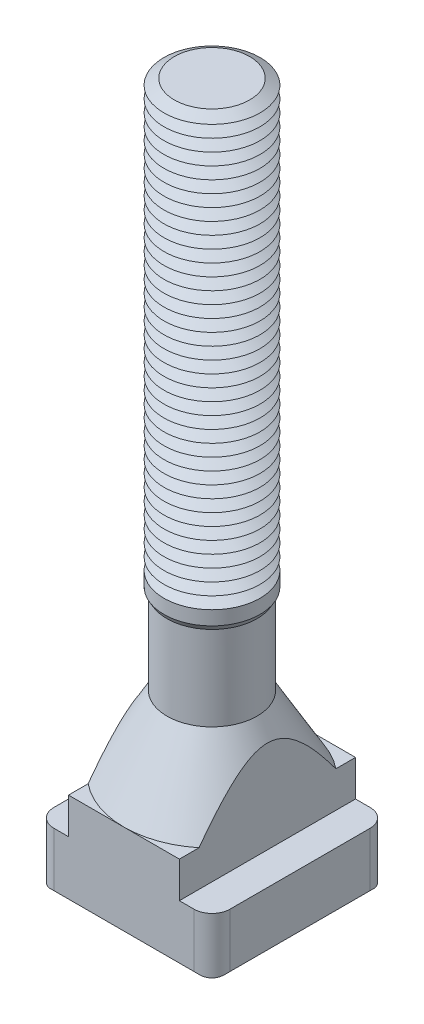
ISO-10303-21;
HEADER;
FILE_DESCRIPTION(('STEP AP214'),'2;1');
FILE_NAME('part.step','',(''),(''),'','','');
FILE_SCHEMA(('AUTOMOTIVE_DESIGN { 1 0 10303 214 1 1 1 1 }'));
ENDSEC;
DATA;
#1=APPLICATION_CONTEXT('core data for automotive mechanical design processes');
#2=APPLICATION_PROTOCOL_DEFINITION('international standard','automotive_design',2000,#1);
#3=PRODUCT_CONTEXT('',#1,'mechanical');
#4=PRODUCT('Part','Part','',(#3));
#5=PRODUCT_RELATED_PRODUCT_CATEGORY('part','',(#4));
#6=PRODUCT_DEFINITION_FORMATION('','',#4);
#7=PRODUCT_DEFINITION_CONTEXT('part definition',#1,'design');
#8=PRODUCT_DEFINITION('design','',#6,#7);
#9=PRODUCT_DEFINITION_SHAPE('','',#8);
#10=(LENGTH_UNIT() NAMED_UNIT(*) SI_UNIT(.MILLI.,.METRE.));
#11=(NAMED_UNIT(*) PLANE_ANGLE_UNIT() SI_UNIT($,.RADIAN.));
#12=(NAMED_UNIT(*) SI_UNIT($,.STERADIAN.) SOLID_ANGLE_UNIT());
#13=UNCERTAINTY_MEASURE_WITH_UNIT(LENGTH_MEASURE(1.E-05),#10,'distance_accuracy_value','');
#14=(GEOMETRIC_REPRESENTATION_CONTEXT(3) GLOBAL_UNCERTAINTY_ASSIGNED_CONTEXT((#13)) GLOBAL_UNIT_ASSIGNED_CONTEXT((#10,
#11,#12)) REPRESENTATION_CONTEXT('',''));
#15=CARTESIAN_POINT('',(0.,0.,0.));
#16=DIRECTION('',(0.,0.,1.));
#17=DIRECTION('',(1.,0.,0.));
#18=AXIS2_PLACEMENT_3D('',#15,#16,#17);
#19=CARTESIAN_POINT('',(0.,166.,0.));
#20=DIRECTION('',(0.,-1.,0.));
#21=DIRECTION('',(0.,0.,-1.));
#22=AXIS2_PLACEMENT_3D('',#19,#20,#21);
#23=CONICAL_SURFACE('',#22,9.40192378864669,1.0471975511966);
#24=CARTESIAN_POINT('',(0.,164.5,0.));
#25=DIRECTION('',(0.,-1.,0.));
#26=DIRECTION('',(0.,0.,-1.));
#27=AXIS2_PLACEMENT_3D('',#24,#25,#26);
#28=CIRCLE('',#27,12.);
#29=CARTESIAN_POINT('',(0.,164.5,-12.));
#30=VERTEX_POINT('',#29);
#31=EDGE_CURVE('E778',#30,#30,#28,.T.);
#32=ORIENTED_EDGE('',*,*,#31,.F.);
#33=EDGE_LOOP('',(#32));
#34=FACE_BOUND('',#33,.T.);
#35=CARTESIAN_POINT('',(0.,166.,0.));
#36=DIRECTION('',(0.,-1.,0.));
#37=DIRECTION('',(0.,0.,-1.));
#38=AXIS2_PLACEMENT_3D('',#35,#36,#37);
#39=CIRCLE('',#38,9.40192378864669);
#40=CARTESIAN_POINT('',(0.,166.,-9.40192378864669));
#41=VERTEX_POINT('',#40);
#42=EDGE_CURVE('E782',#41,#41,#39,.T.);
#43=ORIENTED_EDGE('',*,*,#42,.T.);
#44=EDGE_LOOP('',(#43));
#45=FACE_BOUND('',#44,.T.);
#46=ADVANCED_FACE('F39',(#34,#45),#23,.T.);
#47=CARTESIAN_POINT('',(0.,167.5,0.));
#48=DIRECTION('',(0.,1.,0.));
#49=DIRECTION('',(0.,0.,1.));
#50=AXIS2_PLACEMENT_3D('',#47,#48,#49);
#51=CONICAL_SURFACE('',#50,12.,1.0471975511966);
#52=ORIENTED_EDGE('',*,*,#42,.F.);
#53=EDGE_LOOP('',(#52));
#54=FACE_BOUND('',#53,.T.);
#55=CARTESIAN_POINT('',(0.,167.5,0.));
#56=DIRECTION('',(0.,-1.,0.));
#57=DIRECTION('',(0.,0.,-1.));
#58=AXIS2_PLACEMENT_3D('',#55,#56,#57);
#59=CIRCLE('',#58,12.);
#60=CARTESIAN_POINT('',(0.,167.5,-12.));
#61=VERTEX_POINT('',#60);
#62=EDGE_CURVE('E659',#61,#61,#59,.T.);
#63=ORIENTED_EDGE('',*,*,#62,.T.);
#64=EDGE_LOOP('',(#63));
#65=FACE_BOUND('',#64,.T.);
#66=ADVANCED_FACE('F448',(#54,#65),#51,.T.);
#67=CARTESIAN_POINT('',(5.07442264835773,178.,0.));
#68=DIRECTION('',(0.,-1.,0.));
#69=DIRECTION('',(1.,0.,0.));
#70=AXIS2_PLACEMENT_3D('',#67,#68,#69);
#71=PLANE('',#70);
#72=CARTESIAN_POINT('',(0.,178.,0.));
#73=DIRECTION('',(0.,-1.,0.));
#74=DIRECTION('',(0.,0.,-1.));
#75=AXIS2_PLACEMENT_3D('',#72,#73,#74);
#76=CIRCLE('',#75,9.40192378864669);
#77=CARTESIAN_POINT('',(0.,178.,-9.40192378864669));
#78=VERTEX_POINT('',#77);
#79=EDGE_CURVE('E686',#78,#78,#76,.T.);
#80=ORIENTED_EDGE('',*,*,#79,.F.);
#81=EDGE_LOOP('',(#80));
#82=FACE_BOUND('',#81,.T.);
#83=ADVANCED_FACE('F454',(#82),#71,.F.);
#84=CARTESIAN_POINT('',(0.,178.,0.));
#85=DIRECTION('',(0.,-1.,0.));
#86=DIRECTION('',(0.,0.,-1.));
#87=AXIS2_PLACEMENT_3D('',#84,#85,#86);
#88=CONICAL_SURFACE('',#87,9.40192378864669,1.0471975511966);
#89=CARTESIAN_POINT('',(0.,176.5,0.));
#90=DIRECTION('',(0.,-1.,0.));
#91=DIRECTION('',(0.,0.,-1.));
#92=AXIS2_PLACEMENT_3D('',#89,#90,#91);
#93=CIRCLE('',#92,12.);
#94=CARTESIAN_POINT('',(0.,176.5,-12.));
#95=VERTEX_POINT('',#94);
#96=EDGE_CURVE('E695',#95,#95,#93,.T.);
#97=ORIENTED_EDGE('',*,*,#96,.F.);
#98=EDGE_LOOP('',(#97));
#99=FACE_BOUND('',#98,.T.);
#100=ORIENTED_EDGE('',*,*,#79,.T.);
#101=EDGE_LOOP('',(#100));
#102=FACE_BOUND('',#101,.T.);
#103=ADVANCED_FACE('F482',(#99,#102),#88,.T.);
#104=CARTESIAN_POINT('',(0.,176.5,0.));
#105=DIRECTION('',(0.,1.,0.));
#106=DIRECTION('',(0.,0.,1.));
#107=AXIS2_PLACEMENT_3D('',#104,#105,#106);
#108=CONICAL_SURFACE('',#107,12.,1.0471975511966);
#109=CARTESIAN_POINT('',(0.,175.,0.));
#110=DIRECTION('',(0.,-1.,0.));
#111=DIRECTION('',(0.,0.,-1.));
#112=AXIS2_PLACEMENT_3D('',#109,#110,#111);
#113=CIRCLE('',#112,9.40192378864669);
#114=CARTESIAN_POINT('',(0.,175.,-9.40192378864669));
#115=VERTEX_POINT('',#114);
#116=EDGE_CURVE('E725',#115,#115,#113,.T.);
#117=ORIENTED_EDGE('',*,*,#116,.F.);
#118=EDGE_LOOP('',(#117));
#119=FACE_BOUND('',#118,.T.);
#120=ORIENTED_EDGE('',*,*,#96,.T.);
#121=EDGE_LOOP('',(#120));
#122=FACE_BOUND('',#121,.T.);
#123=ADVANCED_FACE('F479',(#119,#122),#108,.T.);
#124=CARTESIAN_POINT('',(0.,175.,0.));
#125=DIRECTION('',(0.,-1.,0.));
#126=DIRECTION('',(0.,0.,-1.));
#127=AXIS2_PLACEMENT_3D('',#124,#125,#126);
#128=CONICAL_SURFACE('',#127,9.40192378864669,1.0471975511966);
#129=CARTESIAN_POINT('',(0.,173.5,0.));
#130=DIRECTION('',(0.,-1.,0.));
#131=DIRECTION('',(0.,0.,-1.));
#132=AXIS2_PLACEMENT_3D('',#129,#130,#131);
#133=CIRCLE('',#132,12.);
#134=CARTESIAN_POINT('',(0.,173.5,-12.));
#135=VERTEX_POINT('',#134);
#136=EDGE_CURVE('E719',#135,#135,#133,.T.);
#137=ORIENTED_EDGE('',*,*,#136,.F.);
#138=EDGE_LOOP('',(#137));
#139=FACE_BOUND('',#138,.T.);
#140=ORIENTED_EDGE('',*,*,#116,.T.);
#141=EDGE_LOOP('',(#140));
#142=FACE_BOUND('',#141,.T.);
#143=ADVANCED_FACE('F474',(#139,#142),#128,.T.);
#144=CARTESIAN_POINT('',(0.,173.5,0.));
#145=DIRECTION('',(0.,1.,0.));
#146=DIRECTION('',(0.,0.,1.));
#147=AXIS2_PLACEMENT_3D('',#144,#145,#146);
#148=CONICAL_SURFACE('',#147,12.,1.0471975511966);
#149=CARTESIAN_POINT('',(0.,172.,0.));
#150=DIRECTION('',(0.,-1.,0.));
#151=DIRECTION('',(0.,0.,-1.));
#152=AXIS2_PLACEMENT_3D('',#149,#150,#151);
#153=CIRCLE('',#152,9.40192378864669);
#154=CARTESIAN_POINT('',(0.,172.,-9.40192378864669));
#155=VERTEX_POINT('',#154);
#156=EDGE_CURVE('E717',#155,#155,#153,.T.);
#157=ORIENTED_EDGE('',*,*,#156,.F.);
#158=EDGE_LOOP('',(#157));
#159=FACE_BOUND('',#158,.T.);
#160=ORIENTED_EDGE('',*,*,#136,.T.);
#161=EDGE_LOOP('',(#160));
#162=FACE_BOUND('',#161,.T.);
#163=ADVANCED_FACE('F471',(#159,#162),#148,.T.);
#164=CARTESIAN_POINT('',(0.,172.,0.));
#165=DIRECTION('',(0.,-1.,0.));
#166=DIRECTION('',(0.,0.,-1.));
#167=AXIS2_PLACEMENT_3D('',#164,#165,#166);
#168=CONICAL_SURFACE('',#167,9.40192378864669,1.0471975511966);
#169=CARTESIAN_POINT('',(0.,170.5,0.));
#170=DIRECTION('',(0.,-1.,0.));
#171=DIRECTION('',(0.,0.,-1.));
#172=AXIS2_PLACEMENT_3D('',#169,#170,#171);
#173=CIRCLE('',#172,12.);
#174=CARTESIAN_POINT('',(0.,170.5,-12.));
#175=VERTEX_POINT('',#174);
#176=EDGE_CURVE('E658',#175,#175,#173,.T.);
#177=ORIENTED_EDGE('',*,*,#176,.F.);
#178=EDGE_LOOP('',(#177));
#179=FACE_BOUND('',#178,.T.);
#180=ORIENTED_EDGE('',*,*,#156,.T.);
#181=EDGE_LOOP('',(#180));
#182=FACE_BOUND('',#181,.T.);
#183=ADVANCED_FACE('F465',(#179,#182),#168,.T.);
#184=CARTESIAN_POINT('',(0.,170.5,0.));
#185=DIRECTION('',(0.,1.,0.));
#186=DIRECTION('',(0.,0.,1.));
#187=AXIS2_PLACEMENT_3D('',#184,#185,#186);
#188=CONICAL_SURFACE('',#187,12.,1.0471975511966);
#189=CARTESIAN_POINT('',(0.,169.,0.));
#190=DIRECTION('',(0.,-1.,0.));
#191=DIRECTION('',(0.,0.,-1.));
#192=AXIS2_PLACEMENT_3D('',#189,#190,#191);
#193=CIRCLE('',#192,9.40192378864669);
#194=CARTESIAN_POINT('',(0.,169.,-9.40192378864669));
#195=VERTEX_POINT('',#194);
#196=EDGE_CURVE('E656',#195,#195,#193,.T.);
#197=ORIENTED_EDGE('',*,*,#196,.F.);
#198=EDGE_LOOP('',(#197));
#199=FACE_BOUND('',#198,.T.);
#200=ORIENTED_EDGE('',*,*,#176,.T.);
#201=EDGE_LOOP('',(#200));
#202=FACE_BOUND('',#201,.T.);
#203=ADVANCED_FACE('F461',(#199,#202),#188,.T.);
#204=CARTESIAN_POINT('',(0.,169.,0.));
#205=DIRECTION('',(0.,-1.,0.));
#206=DIRECTION('',(0.,0.,-1.));
#207=AXIS2_PLACEMENT_3D('',#204,#205,#206);
#208=CONICAL_SURFACE('',#207,9.40192378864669,1.0471975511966);
#209=ORIENTED_EDGE('',*,*,#62,.F.);
#210=EDGE_LOOP('',(#209));
#211=FACE_BOUND('',#210,.T.);
#212=ORIENTED_EDGE('',*,*,#196,.T.);
#213=EDGE_LOOP('',(#212));
#214=FACE_BOUND('',#213,.T.);
#215=ADVANCED_FACE('F464',(#211,#214),#208,.T.);
#216=CARTESIAN_POINT('',(0.,163.,0.));
#217=DIRECTION('',(0.,-1.,0.));
#218=DIRECTION('',(0.,0.,-1.));
#219=AXIS2_PLACEMENT_3D('',#216,#217,#218);
#220=CONICAL_SURFACE('',#219,9.40192378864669,1.0471975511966);
#221=CARTESIAN_POINT('',(0.,161.5,0.));
#222=DIRECTION('',(0.,-1.,0.));
#223=DIRECTION('',(0.,0.,-1.));
#224=AXIS2_PLACEMENT_3D('',#221,#222,#223);
#225=CIRCLE('',#224,12.);
#226=CARTESIAN_POINT('',(0.,161.5,-12.));
#227=VERTEX_POINT('',#226);
#228=EDGE_CURVE('E770',#227,#227,#225,.T.);
#229=ORIENTED_EDGE('',*,*,#228,.F.);
#230=EDGE_LOOP('',(#229));
#231=FACE_BOUND('',#230,.T.);
#232=CARTESIAN_POINT('',(0.,163.,0.));
#233=DIRECTION('',(0.,-1.,0.));
#234=DIRECTION('',(0.,0.,-1.));
#235=AXIS2_PLACEMENT_3D('',#232,#233,#234);
#236=CIRCLE('',#235,9.40192378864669);
#237=CARTESIAN_POINT('',(0.,163.,-9.40192378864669));
#238=VERTEX_POINT('',#237);
#239=EDGE_CURVE('E774',#238,#238,#236,.T.);
#240=ORIENTED_EDGE('',*,*,#239,.T.);
#241=EDGE_LOOP('',(#240));
#242=FACE_BOUND('',#241,.T.);
#243=ADVANCED_FACE('F469',(#231,#242),#220,.T.);
#244=CARTESIAN_POINT('',(0.,164.5,0.));
#245=DIRECTION('',(0.,1.,0.));
#246=DIRECTION('',(0.,0.,1.));
#247=AXIS2_PLACEMENT_3D('',#244,#245,#246);
#248=CONICAL_SURFACE('',#247,12.,1.0471975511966);
#249=ORIENTED_EDGE('',*,*,#239,.F.);
#250=EDGE_LOOP('',(#249));
#251=FACE_BOUND('',#250,.T.);
#252=ORIENTED_EDGE('',*,*,#31,.T.);
#253=EDGE_LOOP('',(#252));
#254=FACE_BOUND('',#253,.T.);
#255=ADVANCED_FACE('F1287',(#251,#254),#248,.T.);
#256=CARTESIAN_POINT('',(0.,160.,0.));
#257=DIRECTION('',(0.,-1.,0.));
#258=DIRECTION('',(0.,0.,-1.));
#259=AXIS2_PLACEMENT_3D('',#256,#257,#258);
#260=CONICAL_SURFACE('',#259,9.40192378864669,1.0471975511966);
#261=CARTESIAN_POINT('',(0.,158.5,0.));
#262=DIRECTION('',(0.,-1.,0.));
#263=DIRECTION('',(0.,0.,-1.));
#264=AXIS2_PLACEMENT_3D('',#261,#262,#263);
#265=CIRCLE('',#264,12.);
#266=CARTESIAN_POINT('',(0.,158.5,-12.));
#267=VERTEX_POINT('',#266);
#268=EDGE_CURVE('E754',#267,#267,#265,.T.);
#269=ORIENTED_EDGE('',*,*,#268,.F.);
#270=EDGE_LOOP('',(#269));
#271=FACE_BOUND('',#270,.T.);
#272=CARTESIAN_POINT('',(0.,160.,0.));
#273=DIRECTION('',(0.,-1.,0.));
#274=DIRECTION('',(0.,0.,-1.));
#275=AXIS2_PLACEMENT_3D('',#272,#273,#274);
#276=CIRCLE('',#275,9.40192378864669);
#277=CARTESIAN_POINT('',(0.,160.,-9.40192378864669));
#278=VERTEX_POINT('',#277);
#279=EDGE_CURVE('E702',#278,#278,#276,.T.);
#280=ORIENTED_EDGE('',*,*,#279,.T.);
#281=EDGE_LOOP('',(#280));
#282=FACE_BOUND('',#281,.T.);
#283=ADVANCED_FACE('F1283',(#271,#282),#260,.T.);
#284=CARTESIAN_POINT('',(0.,161.5,0.));
#285=DIRECTION('',(0.,1.,0.));
#286=DIRECTION('',(0.,0.,1.));
#287=AXIS2_PLACEMENT_3D('',#284,#285,#286);
#288=CONICAL_SURFACE('',#287,12.,1.0471975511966);
#289=ORIENTED_EDGE('',*,*,#279,.F.);
#290=EDGE_LOOP('',(#289));
#291=FACE_BOUND('',#290,.T.);
#292=ORIENTED_EDGE('',*,*,#228,.T.);
#293=EDGE_LOOP('',(#292));
#294=FACE_BOUND('',#293,.T.);
#295=ADVANCED_FACE('F1279',(#291,#294),#288,.T.);
#296=CARTESIAN_POINT('',(0.,157.,0.));
#297=DIRECTION('',(0.,-1.,0.));
#298=DIRECTION('',(0.,0.,-1.));
#299=AXIS2_PLACEMENT_3D('',#296,#297,#298);
#300=CONICAL_SURFACE('',#299,9.40192378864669,1.0471975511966);
#301=CARTESIAN_POINT('',(0.,155.5,0.));
#302=DIRECTION('',(0.,-1.,0.));
#303=DIRECTION('',(0.,0.,-1.));
#304=AXIS2_PLACEMENT_3D('',#301,#302,#303);
#305=CIRCLE('',#304,12.);
#306=CARTESIAN_POINT('',(0.,155.5,-12.));
#307=VERTEX_POINT('',#306);
#308=EDGE_CURVE('E755',#307,#307,#305,.T.);
#309=ORIENTED_EDGE('',*,*,#308,.F.);
#310=EDGE_LOOP('',(#309));
#311=FACE_BOUND('',#310,.T.);
#312=CARTESIAN_POINT('',(0.,157.,0.));
#313=DIRECTION('',(0.,-1.,0.));
#314=DIRECTION('',(0.,0.,-1.));
#315=AXIS2_PLACEMENT_3D('',#312,#313,#314);
#316=CIRCLE('',#315,9.40192378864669);
#317=CARTESIAN_POINT('',(0.,157.,-9.40192378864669));
#318=VERTEX_POINT('',#317);
#319=EDGE_CURVE('E752',#318,#318,#316,.T.);
#320=ORIENTED_EDGE('',*,*,#319,.T.);
#321=EDGE_LOOP('',(#320));
#322=FACE_BOUND('',#321,.T.);
#323=ADVANCED_FACE('F1275',(#311,#322),#300,.T.);
#324=CARTESIAN_POINT('',(0.,158.5,0.));
#325=DIRECTION('',(0.,1.,0.));
#326=DIRECTION('',(0.,0.,1.));
#327=AXIS2_PLACEMENT_3D('',#324,#325,#326);
#328=CONICAL_SURFACE('',#327,12.,1.0471975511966);
#329=ORIENTED_EDGE('',*,*,#319,.F.);
#330=EDGE_LOOP('',(#329));
#331=FACE_BOUND('',#330,.T.);
#332=ORIENTED_EDGE('',*,*,#268,.T.);
#333=EDGE_LOOP('',(#332));
#334=FACE_BOUND('',#333,.T.);
#335=ADVANCED_FACE('F1271',(#331,#334),#328,.T.);
#336=CARTESIAN_POINT('',(0.,154.,0.));
#337=DIRECTION('',(0.,-1.,0.));
#338=DIRECTION('',(0.,0.,-1.));
#339=AXIS2_PLACEMENT_3D('',#336,#337,#338);
#340=CONICAL_SURFACE('',#339,9.40192378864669,1.0471975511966);
#341=CARTESIAN_POINT('',(0.,152.5,0.));
#342=DIRECTION('',(0.,-1.,0.));
#343=DIRECTION('',(0.,0.,-1.));
#344=AXIS2_PLACEMENT_3D('',#341,#342,#343);
#345=CIRCLE('',#344,12.);
#346=CARTESIAN_POINT('',(0.,152.5,-12.));
#347=VERTEX_POINT('',#346);
#348=EDGE_CURVE('E817',#347,#347,#345,.T.);
#349=ORIENTED_EDGE('',*,*,#348,.F.);
#350=EDGE_LOOP('',(#349));
#351=FACE_BOUND('',#350,.T.);
#352=CARTESIAN_POINT('',(0.,154.,0.));
#353=DIRECTION('',(0.,-1.,0.));
#354=DIRECTION('',(0.,0.,-1.));
#355=AXIS2_PLACEMENT_3D('',#352,#353,#354);
#356=CIRCLE('',#355,9.40192378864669);
#357=CARTESIAN_POINT('',(0.,154.,-9.40192378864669));
#358=VERTEX_POINT('',#357);
#359=EDGE_CURVE('E764',#358,#358,#356,.T.);
#360=ORIENTED_EDGE('',*,*,#359,.T.);
#361=EDGE_LOOP('',(#360));
#362=FACE_BOUND('',#361,.T.);
#363=ADVANCED_FACE('F1267',(#351,#362),#340,.T.);
#364=CARTESIAN_POINT('',(0.,155.5,0.));
#365=DIRECTION('',(0.,1.,0.));
#366=DIRECTION('',(0.,0.,1.));
#367=AXIS2_PLACEMENT_3D('',#364,#365,#366);
#368=CONICAL_SURFACE('',#367,12.,1.0471975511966);
#369=ORIENTED_EDGE('',*,*,#359,.F.);
#370=EDGE_LOOP('',(#369));
#371=FACE_BOUND('',#370,.T.);
#372=ORIENTED_EDGE('',*,*,#308,.T.);
#373=EDGE_LOOP('',(#372));
#374=FACE_BOUND('',#373,.T.);
#375=ADVANCED_FACE('F1256',(#371,#374),#368,.T.);
#376=CARTESIAN_POINT('',(0.,151.,0.));
#377=DIRECTION('',(0.,-1.,0.));
#378=DIRECTION('',(0.,0.,-1.));
#379=AXIS2_PLACEMENT_3D('',#376,#377,#378);
#380=CONICAL_SURFACE('',#379,9.40192378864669,1.0471975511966);
#381=CARTESIAN_POINT('',(0.,149.5,0.));
#382=DIRECTION('',(0.,-1.,0.));
#383=DIRECTION('',(0.,0.,-1.));
#384=AXIS2_PLACEMENT_3D('',#381,#382,#383);
#385=CIRCLE('',#384,12.);
#386=CARTESIAN_POINT('',(0.,149.5,-12.));
#387=VERTEX_POINT('',#386);
#388=EDGE_CURVE('E827',#387,#387,#385,.T.);
#389=ORIENTED_EDGE('',*,*,#388,.F.);
#390=EDGE_LOOP('',(#389));
#391=FACE_BOUND('',#390,.T.);
#392=CARTESIAN_POINT('',(0.,151.,0.));
#393=DIRECTION('',(0.,-1.,0.));
#394=DIRECTION('',(0.,0.,-1.));
#395=AXIS2_PLACEMENT_3D('',#392,#393,#394);
#396=CIRCLE('',#395,9.40192378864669);
#397=CARTESIAN_POINT('',(0.,151.,-9.40192378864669));
#398=VERTEX_POINT('',#397);
#399=EDGE_CURVE('E819',#398,#398,#396,.T.);
#400=ORIENTED_EDGE('',*,*,#399,.T.);
#401=EDGE_LOOP('',(#400));
#402=FACE_BOUND('',#401,.T.);
#403=ADVANCED_FACE('F1253',(#391,#402),#380,.T.);
#404=CARTESIAN_POINT('',(0.,152.5,0.));
#405=DIRECTION('',(0.,1.,0.));
#406=DIRECTION('',(0.,0.,1.));
#407=AXIS2_PLACEMENT_3D('',#404,#405,#406);
#408=CONICAL_SURFACE('',#407,12.,1.0471975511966);
#409=ORIENTED_EDGE('',*,*,#399,.F.);
#410=EDGE_LOOP('',(#409));
#411=FACE_BOUND('',#410,.T.);
#412=ORIENTED_EDGE('',*,*,#348,.T.);
#413=EDGE_LOOP('',(#412));
#414=FACE_BOUND('',#413,.T.);
#415=ADVANCED_FACE('F1244',(#411,#414),#408,.T.);
#416=CARTESIAN_POINT('',(0.,148.,0.));
#417=DIRECTION('',(0.,-1.,0.));
#418=DIRECTION('',(0.,0.,-1.));
#419=AXIS2_PLACEMENT_3D('',#416,#417,#418);
#420=CONICAL_SURFACE('',#419,9.40192378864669,1.0471975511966);
#421=CARTESIAN_POINT('',(0.,146.5,0.));
#422=DIRECTION('',(0.,-1.,0.));
#423=DIRECTION('',(0.,0.,-1.));
#424=AXIS2_PLACEMENT_3D('',#421,#422,#423);
#425=CIRCLE('',#424,12.);
#426=CARTESIAN_POINT('',(0.,146.5,-12.));
#427=VERTEX_POINT('',#426);
#428=EDGE_CURVE('E677',#427,#427,#425,.T.);
#429=ORIENTED_EDGE('',*,*,#428,.F.);
#430=EDGE_LOOP('',(#429));
#431=FACE_BOUND('',#430,.T.);
#432=CARTESIAN_POINT('',(0.,148.,0.));
#433=DIRECTION('',(0.,-1.,0.));
#434=DIRECTION('',(0.,0.,-1.));
#435=AXIS2_PLACEMENT_3D('',#432,#433,#434);
#436=CIRCLE('',#435,9.40192378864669);
#437=CARTESIAN_POINT('',(0.,148.,-9.40192378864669));
#438=VERTEX_POINT('',#437);
#439=EDGE_CURVE('E680',#438,#438,#436,.T.);
#440=ORIENTED_EDGE('',*,*,#439,.T.);
#441=EDGE_LOOP('',(#440));
#442=FACE_BOUND('',#441,.T.);
#443=ADVANCED_FACE('F1241',(#431,#442),#420,.T.);
#444=CARTESIAN_POINT('',(0.,149.5,0.));
#445=DIRECTION('',(0.,1.,0.));
#446=DIRECTION('',(0.,0.,1.));
#447=AXIS2_PLACEMENT_3D('',#444,#445,#446);
#448=CONICAL_SURFACE('',#447,12.,1.0471975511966);
#449=ORIENTED_EDGE('',*,*,#439,.F.);
#450=EDGE_LOOP('',(#449));
#451=FACE_BOUND('',#450,.T.);
#452=ORIENTED_EDGE('',*,*,#388,.T.);
#453=EDGE_LOOP('',(#452));
#454=FACE_BOUND('',#453,.T.);
#455=ADVANCED_FACE('F1232',(#451,#454),#448,.T.);
#456=CARTESIAN_POINT('',(0.,145.,0.));
#457=DIRECTION('',(0.,-1.,0.));
#458=DIRECTION('',(0.,0.,-1.));
#459=AXIS2_PLACEMENT_3D('',#456,#457,#458);
#460=CONICAL_SURFACE('',#459,9.40192378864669,1.0471975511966);
#461=CARTESIAN_POINT('',(0.,143.5,0.));
#462=DIRECTION('',(0.,-1.,0.));
#463=DIRECTION('',(0.,0.,-1.));
#464=AXIS2_PLACEMENT_3D('',#461,#462,#463);
#465=CIRCLE('',#464,12.);
#466=CARTESIAN_POINT('',(0.,143.5,-12.));
#467=VERTEX_POINT('',#466);
#468=EDGE_CURVE('E837',#467,#467,#465,.T.);
#469=ORIENTED_EDGE('',*,*,#468,.F.);
#470=EDGE_LOOP('',(#469));
#471=FACE_BOUND('',#470,.T.);
#472=CARTESIAN_POINT('',(0.,145.,0.));
#473=DIRECTION('',(0.,-1.,0.));
#474=DIRECTION('',(0.,0.,-1.));
#475=AXIS2_PLACEMENT_3D('',#472,#473,#474);
#476=CIRCLE('',#475,9.40192378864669);
#477=CARTESIAN_POINT('',(0.,145.,-9.40192378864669));
#478=VERTEX_POINT('',#477);
#479=EDGE_CURVE('E681',#478,#478,#476,.T.);
#480=ORIENTED_EDGE('',*,*,#479,.T.);
#481=EDGE_LOOP('',(#480));
#482=FACE_BOUND('',#481,.T.);
#483=ADVANCED_FACE('F1229',(#471,#482),#460,.T.);
#484=CARTESIAN_POINT('',(0.,146.5,0.));
#485=DIRECTION('',(0.,1.,0.));
#486=DIRECTION('',(0.,0.,1.));
#487=AXIS2_PLACEMENT_3D('',#484,#485,#486);
#488=CONICAL_SURFACE('',#487,12.,1.0471975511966);
#489=ORIENTED_EDGE('',*,*,#479,.F.);
#490=EDGE_LOOP('',(#489));
#491=FACE_BOUND('',#490,.T.);
#492=ORIENTED_EDGE('',*,*,#428,.T.);
#493=EDGE_LOOP('',(#492));
#494=FACE_BOUND('',#493,.T.);
#495=ADVANCED_FACE('F1220',(#491,#494),#488,.T.);
#496=CARTESIAN_POINT('',(0.,142.,0.));
#497=DIRECTION('',(0.,-1.,0.));
#498=DIRECTION('',(0.,0.,-1.));
#499=AXIS2_PLACEMENT_3D('',#496,#497,#498);
#500=CONICAL_SURFACE('',#499,9.40192378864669,1.0471975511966);
#501=CARTESIAN_POINT('',(0.,140.5,0.));
#502=DIRECTION('',(0.,-1.,0.));
#503=DIRECTION('',(0.,0.,-1.));
#504=AXIS2_PLACEMENT_3D('',#501,#502,#503);
#505=CIRCLE('',#504,12.);
#506=CARTESIAN_POINT('',(0.,140.5,-12.));
#507=VERTEX_POINT('',#506);
#508=EDGE_CURVE('E711',#507,#507,#505,.T.);
#509=ORIENTED_EDGE('',*,*,#508,.F.);
#510=EDGE_LOOP('',(#509));
#511=FACE_BOUND('',#510,.T.);
#512=CARTESIAN_POINT('',(0.,142.,0.));
#513=DIRECTION('',(0.,-1.,0.));
#514=DIRECTION('',(0.,0.,-1.));
#515=AXIS2_PLACEMENT_3D('',#512,#513,#514);
#516=CIRCLE('',#515,9.40192378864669);
#517=CARTESIAN_POINT('',(0.,142.,-9.40192378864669));
#518=VERTEX_POINT('',#517);
#519=EDGE_CURVE('E714',#518,#518,#516,.T.);
#520=ORIENTED_EDGE('',*,*,#519,.T.);
#521=EDGE_LOOP('',(#520));
#522=FACE_BOUND('',#521,.T.);
#523=ADVANCED_FACE('F1217',(#511,#522),#500,.T.);
#524=CARTESIAN_POINT('',(0.,143.5,0.));
#525=DIRECTION('',(0.,1.,0.));
#526=DIRECTION('',(0.,0.,1.));
#527=AXIS2_PLACEMENT_3D('',#524,#525,#526);
#528=CONICAL_SURFACE('',#527,12.,1.0471975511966);
#529=ORIENTED_EDGE('',*,*,#519,.F.);
#530=EDGE_LOOP('',(#529));
#531=FACE_BOUND('',#530,.T.);
#532=ORIENTED_EDGE('',*,*,#468,.T.);
#533=EDGE_LOOP('',(#532));
#534=FACE_BOUND('',#533,.T.);
#535=ADVANCED_FACE('F1208',(#531,#534),#528,.T.);
#536=CARTESIAN_POINT('',(0.,139.,0.));
#537=DIRECTION('',(0.,-1.,0.));
#538=DIRECTION('',(0.,0.,-1.));
#539=AXIS2_PLACEMENT_3D('',#536,#537,#538);
#540=CONICAL_SURFACE('',#539,9.40192378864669,1.0471975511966);
#541=CARTESIAN_POINT('',(0.,137.5,0.));
#542=DIRECTION('',(0.,-1.,0.));
#543=DIRECTION('',(0.,0.,-1.));
#544=AXIS2_PLACEMENT_3D('',#541,#542,#543);
#545=CIRCLE('',#544,12.);
#546=CARTESIAN_POINT('',(0.,137.5,-12.));
#547=VERTEX_POINT('',#546);
#548=EDGE_CURVE('E847',#547,#547,#545,.T.);
#549=ORIENTED_EDGE('',*,*,#548,.F.);
#550=EDGE_LOOP('',(#549));
#551=FACE_BOUND('',#550,.T.);
#552=CARTESIAN_POINT('',(0.,139.,0.));
#553=DIRECTION('',(0.,-1.,0.));
#554=DIRECTION('',(0.,0.,-1.));
#555=AXIS2_PLACEMENT_3D('',#552,#553,#554);
#556=CIRCLE('',#555,9.40192378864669);
#557=CARTESIAN_POINT('',(0.,139.,-9.40192378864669));
#558=VERTEX_POINT('',#557);
#559=EDGE_CURVE('E715',#558,#558,#556,.T.);
#560=ORIENTED_EDGE('',*,*,#559,.T.);
#561=EDGE_LOOP('',(#560));
#562=FACE_BOUND('',#561,.T.);
#563=ADVANCED_FACE('F1205',(#551,#562),#540,.T.);
#564=CARTESIAN_POINT('',(0.,140.5,0.));
#565=DIRECTION('',(0.,1.,0.));
#566=DIRECTION('',(0.,0.,1.));
#567=AXIS2_PLACEMENT_3D('',#564,#565,#566);
#568=CONICAL_SURFACE('',#567,12.,1.0471975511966);
#569=ORIENTED_EDGE('',*,*,#559,.F.);
#570=EDGE_LOOP('',(#569));
#571=FACE_BOUND('',#570,.T.);
#572=ORIENTED_EDGE('',*,*,#508,.T.);
#573=EDGE_LOOP('',(#572));
#574=FACE_BOUND('',#573,.T.);
#575=ADVANCED_FACE('F1196',(#571,#574),#568,.T.);
#576=CARTESIAN_POINT('',(0.,136.,0.));
#577=DIRECTION('',(0.,-1.,0.));
#578=DIRECTION('',(0.,0.,-1.));
#579=AXIS2_PLACEMENT_3D('',#576,#577,#578);
#580=CONICAL_SURFACE('',#579,9.40192378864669,1.0471975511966);
#581=CARTESIAN_POINT('',(0.,134.5,0.));
#582=DIRECTION('',(0.,-1.,0.));
#583=DIRECTION('',(0.,0.,-1.));
#584=AXIS2_PLACEMENT_3D('',#581,#582,#583);
#585=CIRCLE('',#584,12.);
#586=CARTESIAN_POINT('',(0.,134.5,-12.));
#587=VERTEX_POINT('',#586);
#588=EDGE_CURVE('E805',#587,#587,#585,.T.);
#589=ORIENTED_EDGE('',*,*,#588,.F.);
#590=EDGE_LOOP('',(#589));
#591=FACE_BOUND('',#590,.T.);
#592=CARTESIAN_POINT('',(0.,136.,0.));
#593=DIRECTION('',(0.,-1.,0.));
#594=DIRECTION('',(0.,0.,-1.));
#595=AXIS2_PLACEMENT_3D('',#592,#593,#594);
#596=CIRCLE('',#595,9.40192378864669);
#597=CARTESIAN_POINT('',(0.,136.,-9.40192378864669));
#598=VERTEX_POINT('',#597);
#599=EDGE_CURVE('E850',#598,#598,#596,.T.);
#600=ORIENTED_EDGE('',*,*,#599,.T.);
#601=EDGE_LOOP('',(#600));
#602=FACE_BOUND('',#601,.T.);
#603=ADVANCED_FACE('F1193',(#591,#602),#580,.T.);
#604=CARTESIAN_POINT('',(0.,137.5,0.));
#605=DIRECTION('',(0.,1.,0.));
#606=DIRECTION('',(0.,0.,1.));
#607=AXIS2_PLACEMENT_3D('',#604,#605,#606);
#608=CONICAL_SURFACE('',#607,12.,1.0471975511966);
#609=ORIENTED_EDGE('',*,*,#599,.F.);
#610=EDGE_LOOP('',(#609));
#611=FACE_BOUND('',#610,.T.);
#612=ORIENTED_EDGE('',*,*,#548,.T.);
#613=EDGE_LOOP('',(#612));
#614=FACE_BOUND('',#613,.T.);
#615=ADVANCED_FACE('F1184',(#611,#614),#608,.T.);
#616=CARTESIAN_POINT('',(0.,133.,0.));
#617=DIRECTION('',(0.,-1.,0.));
#618=DIRECTION('',(0.,0.,-1.));
#619=AXIS2_PLACEMENT_3D('',#616,#617,#618);
#620=CONICAL_SURFACE('',#619,9.40192378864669,1.0471975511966);
#621=CARTESIAN_POINT('',(0.,131.5,0.));
#622=DIRECTION('',(0.,-1.,0.));
#623=DIRECTION('',(0.,0.,-1.));
#624=AXIS2_PLACEMENT_3D('',#621,#622,#623);
#625=CIRCLE('',#624,12.);
#626=CARTESIAN_POINT('',(0.,131.5,-12.));
#627=VERTEX_POINT('',#626);
#628=EDGE_CURVE('E653',#627,#627,#625,.T.);
#629=ORIENTED_EDGE('',*,*,#628,.F.);
#630=EDGE_LOOP('',(#629));
#631=FACE_BOUND('',#630,.T.);
#632=CARTESIAN_POINT('',(0.,133.,0.));
#633=DIRECTION('',(0.,-1.,0.));
#634=DIRECTION('',(0.,0.,-1.));
#635=AXIS2_PLACEMENT_3D('',#632,#633,#634);
#636=CIRCLE('',#635,9.40192378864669);
#637=CARTESIAN_POINT('',(0.,133.,-9.40192378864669));
#638=VERTEX_POINT('',#637);
#639=EDGE_CURVE('E802',#638,#638,#636,.T.);
#640=ORIENTED_EDGE('',*,*,#639,.T.);
#641=EDGE_LOOP('',(#640));
#642=FACE_BOUND('',#641,.T.);
#643=ADVANCED_FACE('F1181',(#631,#642),#620,.T.);
#644=CARTESIAN_POINT('',(0.,134.5,0.));
#645=DIRECTION('',(0.,1.,0.));
#646=DIRECTION('',(0.,0.,1.));
#647=AXIS2_PLACEMENT_3D('',#644,#645,#646);
#648=CONICAL_SURFACE('',#647,12.,1.0471975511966);
#649=ORIENTED_EDGE('',*,*,#639,.F.);
#650=EDGE_LOOP('',(#649));
#651=FACE_BOUND('',#650,.T.);
#652=ORIENTED_EDGE('',*,*,#588,.T.);
#653=EDGE_LOOP('',(#652));
#654=FACE_BOUND('',#653,.T.);
#655=ADVANCED_FACE('F1172',(#651,#654),#648,.T.);
#656=CARTESIAN_POINT('',(0.,130.,0.));
#657=DIRECTION('',(0.,-1.,0.));
#658=DIRECTION('',(0.,0.,-1.));
#659=AXIS2_PLACEMENT_3D('',#656,#657,#658);
#660=CONICAL_SURFACE('',#659,9.40192378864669,1.0471975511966);
#661=CARTESIAN_POINT('',(0.,128.5,0.));
#662=DIRECTION('',(0.,-1.,0.));
#663=DIRECTION('',(0.,0.,-1.));
#664=AXIS2_PLACEMENT_3D('',#661,#662,#663);
#665=CIRCLE('',#664,12.);
#666=CARTESIAN_POINT('',(0.,128.5,-12.));
#667=VERTEX_POINT('',#666);
#668=EDGE_CURVE('E654',#667,#667,#665,.T.);
#669=ORIENTED_EDGE('',*,*,#668,.F.);
#670=EDGE_LOOP('',(#669));
#671=FACE_BOUND('',#670,.T.);
#672=CARTESIAN_POINT('',(0.,130.,0.));
#673=DIRECTION('',(0.,-1.,0.));
#674=DIRECTION('',(0.,0.,-1.));
#675=AXIS2_PLACEMENT_3D('',#672,#673,#674);
#676=CIRCLE('',#675,9.40192378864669);
#677=CARTESIAN_POINT('',(0.,130.,-9.40192378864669));
#678=VERTEX_POINT('',#677);
#679=EDGE_CURVE('E650',#678,#678,#676,.T.);
#680=ORIENTED_EDGE('',*,*,#679,.T.);
#681=EDGE_LOOP('',(#680));
#682=FACE_BOUND('',#681,.T.);
#683=ADVANCED_FACE('F1169',(#671,#682),#660,.T.);
#684=CARTESIAN_POINT('',(0.,131.5,0.));
#685=DIRECTION('',(0.,1.,0.));
#686=DIRECTION('',(0.,0.,1.));
#687=AXIS2_PLACEMENT_3D('',#684,#685,#686);
#688=CONICAL_SURFACE('',#687,12.,1.0471975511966);
#689=ORIENTED_EDGE('',*,*,#679,.F.);
#690=EDGE_LOOP('',(#689));
#691=FACE_BOUND('',#690,.T.);
#692=ORIENTED_EDGE('',*,*,#628,.T.);
#693=EDGE_LOOP('',(#692));
#694=FACE_BOUND('',#693,.T.);
#695=ADVANCED_FACE('F1160',(#691,#694),#688,.T.);
#696=CARTESIAN_POINT('',(0.,127.,0.));
#697=DIRECTION('',(0.,-1.,0.));
#698=DIRECTION('',(0.,0.,-1.));
#699=AXIS2_PLACEMENT_3D('',#696,#697,#698);
#700=CONICAL_SURFACE('',#699,9.40192378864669,1.0471975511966);
#701=CARTESIAN_POINT('',(0.,125.5,0.));
#702=DIRECTION('',(0.,-1.,0.));
#703=DIRECTION('',(0.,0.,-1.));
#704=AXIS2_PLACEMENT_3D('',#701,#702,#703);
#705=CIRCLE('',#704,12.);
#706=CARTESIAN_POINT('',(0.,125.5,-12.));
#707=VERTEX_POINT('',#706);
#708=EDGE_CURVE('E675',#707,#707,#705,.T.);
#709=ORIENTED_EDGE('',*,*,#708,.F.);
#710=EDGE_LOOP('',(#709));
#711=FACE_BOUND('',#710,.T.);
#712=CARTESIAN_POINT('',(0.,127.,0.));
#713=DIRECTION('',(0.,-1.,0.));
#714=DIRECTION('',(0.,0.,-1.));
#715=AXIS2_PLACEMENT_3D('',#712,#713,#714);
#716=CIRCLE('',#715,9.40192378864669);
#717=CARTESIAN_POINT('',(0.,127.,-9.40192378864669));
#718=VERTEX_POINT('',#717);
#719=EDGE_CURVE('E672',#718,#718,#716,.T.);
#720=ORIENTED_EDGE('',*,*,#719,.T.);
#721=EDGE_LOOP('',(#720));
#722=FACE_BOUND('',#721,.T.);
#723=ADVANCED_FACE('F1157',(#711,#722),#700,.T.);
#724=CARTESIAN_POINT('',(0.,128.5,0.));
#725=DIRECTION('',(0.,1.,0.));
#726=DIRECTION('',(0.,0.,1.));
#727=AXIS2_PLACEMENT_3D('',#724,#725,#726);
#728=CONICAL_SURFACE('',#727,12.,1.0471975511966);
#729=ORIENTED_EDGE('',*,*,#719,.F.);
#730=EDGE_LOOP('',(#729));
#731=FACE_BOUND('',#730,.T.);
#732=ORIENTED_EDGE('',*,*,#668,.T.);
#733=EDGE_LOOP('',(#732));
#734=FACE_BOUND('',#733,.T.);
#735=ADVANCED_FACE('F1148',(#731,#734),#728,.T.);
#736=CARTESIAN_POINT('',(0.,124.,0.));
#737=DIRECTION('',(0.,-1.,0.));
#738=DIRECTION('',(0.,0.,-1.));
#739=AXIS2_PLACEMENT_3D('',#736,#737,#738);
#740=CONICAL_SURFACE('',#739,9.40192378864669,1.0471975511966);
#741=CARTESIAN_POINT('',(0.,122.5,0.));
#742=DIRECTION('',(0.,-1.,0.));
#743=DIRECTION('',(0.,0.,-1.));
#744=AXIS2_PLACEMENT_3D('',#741,#742,#743);
#745=CIRCLE('',#744,12.);
#746=CARTESIAN_POINT('',(0.,122.5,-12.));
#747=VERTEX_POINT('',#746);
#748=EDGE_CURVE('E750',#747,#747,#745,.T.);
#749=ORIENTED_EDGE('',*,*,#748,.F.);
#750=EDGE_LOOP('',(#749));
#751=FACE_BOUND('',#750,.T.);
#752=CARTESIAN_POINT('',(0.,124.,0.));
#753=DIRECTION('',(0.,-1.,0.));
#754=DIRECTION('',(0.,0.,-1.));
#755=AXIS2_PLACEMENT_3D('',#752,#753,#754);
#756=CIRCLE('',#755,9.40192378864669);
#757=CARTESIAN_POINT('',(0.,124.,-9.40192378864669));
#758=VERTEX_POINT('',#757);
#759=EDGE_CURVE('E748',#758,#758,#756,.T.);
#760=ORIENTED_EDGE('',*,*,#759,.T.);
#761=EDGE_LOOP('',(#760));
#762=FACE_BOUND('',#761,.T.);
#763=ADVANCED_FACE('F1145',(#751,#762),#740,.T.);
#764=CARTESIAN_POINT('',(0.,125.5,0.));
#765=DIRECTION('',(0.,1.,0.));
#766=DIRECTION('',(0.,0.,1.));
#767=AXIS2_PLACEMENT_3D('',#764,#765,#766);
#768=CONICAL_SURFACE('',#767,12.,1.0471975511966);
#769=ORIENTED_EDGE('',*,*,#759,.F.);
#770=EDGE_LOOP('',(#769));
#771=FACE_BOUND('',#770,.T.);
#772=ORIENTED_EDGE('',*,*,#708,.T.);
#773=EDGE_LOOP('',(#772));
#774=FACE_BOUND('',#773,.T.);
#775=ADVANCED_FACE('F1136',(#771,#774),#768,.T.);
#776=CARTESIAN_POINT('',(0.,121.,0.));
#777=DIRECTION('',(0.,-1.,0.));
#778=DIRECTION('',(0.,0.,-1.));
#779=AXIS2_PLACEMENT_3D('',#776,#777,#778);
#780=CONICAL_SURFACE('',#779,9.40192378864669,1.0471975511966);
#781=CARTESIAN_POINT('',(0.,119.5,0.));
#782=DIRECTION('',(0.,-1.,0.));
#783=DIRECTION('',(0.,0.,-1.));
#784=AXIS2_PLACEMENT_3D('',#781,#782,#783);
#785=CIRCLE('',#784,12.);
#786=CARTESIAN_POINT('',(0.,119.5,-12.));
#787=VERTEX_POINT('',#786);
#788=EDGE_CURVE('E868',#787,#787,#785,.T.);
#789=ORIENTED_EDGE('',*,*,#788,.F.);
#790=EDGE_LOOP('',(#789));
#791=FACE_BOUND('',#790,.T.);
#792=CARTESIAN_POINT('',(0.,121.,0.));
#793=DIRECTION('',(0.,-1.,0.));
#794=DIRECTION('',(0.,0.,-1.));
#795=AXIS2_PLACEMENT_3D('',#792,#793,#794);
#796=CIRCLE('',#795,9.40192378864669);
#797=CARTESIAN_POINT('',(0.,121.,-9.40192378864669));
#798=VERTEX_POINT('',#797);
#799=EDGE_CURVE('E865',#798,#798,#796,.T.);
#800=ORIENTED_EDGE('',*,*,#799,.T.);
#801=EDGE_LOOP('',(#800));
#802=FACE_BOUND('',#801,.T.);
#803=ADVANCED_FACE('F1133',(#791,#802),#780,.T.);
#804=CARTESIAN_POINT('',(0.,122.5,0.));
#805=DIRECTION('',(0.,1.,0.));
#806=DIRECTION('',(0.,0.,1.));
#807=AXIS2_PLACEMENT_3D('',#804,#805,#806);
#808=CONICAL_SURFACE('',#807,12.,1.0471975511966);
#809=ORIENTED_EDGE('',*,*,#799,.F.);
#810=EDGE_LOOP('',(#809));
#811=FACE_BOUND('',#810,.T.);
#812=ORIENTED_EDGE('',*,*,#748,.T.);
#813=EDGE_LOOP('',(#812));
#814=FACE_BOUND('',#813,.T.);
#815=ADVANCED_FACE('F1124',(#811,#814),#808,.T.);
#816=CARTESIAN_POINT('',(0.,118.,0.));
#817=DIRECTION('',(0.,-1.,0.));
#818=DIRECTION('',(0.,0.,-1.));
#819=AXIS2_PLACEMENT_3D('',#816,#817,#818);
#820=CONICAL_SURFACE('',#819,9.40192378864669,1.0471975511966);
#821=CARTESIAN_POINT('',(0.,116.5,0.));
#822=DIRECTION('',(0.,-1.,0.));
#823=DIRECTION('',(0.,0.,-1.));
#824=AXIS2_PLACEMENT_3D('',#821,#822,#823);
#825=CIRCLE('',#824,12.);
#826=CARTESIAN_POINT('',(0.,116.5,-12.));
#827=VERTEX_POINT('',#826);
#828=EDGE_CURVE('E647',#827,#827,#825,.T.);
#829=ORIENTED_EDGE('',*,*,#828,.F.);
#830=EDGE_LOOP('',(#829));
#831=FACE_BOUND('',#830,.T.);
#832=CARTESIAN_POINT('',(0.,118.,0.));
#833=DIRECTION('',(0.,-1.,0.));
#834=DIRECTION('',(0.,0.,-1.));
#835=AXIS2_PLACEMENT_3D('',#832,#833,#834);
#836=CIRCLE('',#835,9.40192378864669);
#837=CARTESIAN_POINT('',(0.,118.,-9.40192378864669));
#838=VERTEX_POINT('',#837);
#839=EDGE_CURVE('E815',#838,#838,#836,.T.);
#840=ORIENTED_EDGE('',*,*,#839,.T.);
#841=EDGE_LOOP('',(#840));
#842=FACE_BOUND('',#841,.T.);
#843=ADVANCED_FACE('F1121',(#831,#842),#820,.T.);
#844=CARTESIAN_POINT('',(0.,119.5,0.));
#845=DIRECTION('',(0.,1.,0.));
#846=DIRECTION('',(0.,0.,1.));
#847=AXIS2_PLACEMENT_3D('',#844,#845,#846);
#848=CONICAL_SURFACE('',#847,12.,1.0471975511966);
#849=ORIENTED_EDGE('',*,*,#839,.F.);
#850=EDGE_LOOP('',(#849));
#851=FACE_BOUND('',#850,.T.);
#852=ORIENTED_EDGE('',*,*,#788,.T.);
#853=EDGE_LOOP('',(#852));
#854=FACE_BOUND('',#853,.T.);
#855=ADVANCED_FACE('F1112',(#851,#854),#848,.T.);
#856=CARTESIAN_POINT('',(0.,115.,0.));
#857=DIRECTION('',(0.,-1.,0.));
#858=DIRECTION('',(0.,0.,-1.));
#859=AXIS2_PLACEMENT_3D('',#856,#857,#858);
#860=CONICAL_SURFACE('',#859,9.40192378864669,1.0471975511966);
#861=CARTESIAN_POINT('',(0.,113.5,0.));
#862=DIRECTION('',(0.,-1.,0.));
#863=DIRECTION('',(0.,0.,-1.));
#864=AXIS2_PLACEMENT_3D('',#861,#862,#863);
#865=CIRCLE('',#864,12.);
#866=CARTESIAN_POINT('',(0.,113.5,-12.));
#867=VERTEX_POINT('',#866);
#868=EDGE_CURVE('E648',#867,#867,#865,.T.);
#869=ORIENTED_EDGE('',*,*,#868,.F.);
#870=EDGE_LOOP('',(#869));
#871=FACE_BOUND('',#870,.T.);
#872=CARTESIAN_POINT('',(0.,115.,0.));
#873=DIRECTION('',(0.,-1.,0.));
#874=DIRECTION('',(0.,0.,-1.));
#875=AXIS2_PLACEMENT_3D('',#872,#873,#874);
#876=CIRCLE('',#875,9.40192378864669);
#877=CARTESIAN_POINT('',(0.,115.,-9.40192378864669));
#878=VERTEX_POINT('',#877);
#879=EDGE_CURVE('E644',#878,#878,#876,.T.);
#880=ORIENTED_EDGE('',*,*,#879,.T.);
#881=EDGE_LOOP('',(#880));
#882=FACE_BOUND('',#881,.T.);
#883=ADVANCED_FACE('F1109',(#871,#882),#860,.T.);
#884=CARTESIAN_POINT('',(0.,116.5,0.));
#885=DIRECTION('',(0.,1.,0.));
#886=DIRECTION('',(0.,0.,1.));
#887=AXIS2_PLACEMENT_3D('',#884,#885,#886);
#888=CONICAL_SURFACE('',#887,12.,1.0471975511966);
#889=ORIENTED_EDGE('',*,*,#879,.F.);
#890=EDGE_LOOP('',(#889));
#891=FACE_BOUND('',#890,.T.);
#892=ORIENTED_EDGE('',*,*,#828,.T.);
#893=EDGE_LOOP('',(#892));
#894=FACE_BOUND('',#893,.T.);
#895=ADVANCED_FACE('F1100',(#891,#894),#888,.T.);
#896=CARTESIAN_POINT('',(0.,112.,0.));
#897=DIRECTION('',(0.,-1.,0.));
#898=DIRECTION('',(0.,0.,-1.));
#899=AXIS2_PLACEMENT_3D('',#896,#897,#898);
#900=CONICAL_SURFACE('',#899,9.40192378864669,1.0471975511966);
#901=CARTESIAN_POINT('',(0.,110.5,0.));
#902=DIRECTION('',(0.,-1.,0.));
#903=DIRECTION('',(0.,0.,-1.));
#904=AXIS2_PLACEMENT_3D('',#901,#902,#903);
#905=CIRCLE('',#904,12.);
#906=CARTESIAN_POINT('',(0.,110.5,-12.));
#907=VERTEX_POINT('',#906);
#908=EDGE_CURVE('E878',#907,#907,#905,.T.);
#909=ORIENTED_EDGE('',*,*,#908,.F.);
#910=EDGE_LOOP('',(#909));
#911=FACE_BOUND('',#910,.T.);
#912=CARTESIAN_POINT('',(0.,112.,0.));
#913=DIRECTION('',(0.,-1.,0.));
#914=DIRECTION('',(0.,0.,-1.));
#915=AXIS2_PLACEMENT_3D('',#912,#913,#914);
#916=CIRCLE('',#915,9.40192378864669);
#917=CARTESIAN_POINT('',(0.,112.,-9.40192378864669));
#918=VERTEX_POINT('',#917);
#919=EDGE_CURVE('E670',#918,#918,#916,.T.);
#920=ORIENTED_EDGE('',*,*,#919,.T.);
#921=EDGE_LOOP('',(#920));
#922=FACE_BOUND('',#921,.T.);
#923=ADVANCED_FACE('F1097',(#911,#922),#900,.T.);
#924=CARTESIAN_POINT('',(0.,113.5,0.));
#925=DIRECTION('',(0.,1.,0.));
#926=DIRECTION('',(0.,0.,1.));
#927=AXIS2_PLACEMENT_3D('',#924,#925,#926);
#928=CONICAL_SURFACE('',#927,12.,1.0471975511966);
#929=ORIENTED_EDGE('',*,*,#919,.F.);
#930=EDGE_LOOP('',(#929));
#931=FACE_BOUND('',#930,.T.);
#932=ORIENTED_EDGE('',*,*,#868,.T.);
#933=EDGE_LOOP('',(#932));
#934=FACE_BOUND('',#933,.T.);
#935=ADVANCED_FACE('F1088',(#931,#934),#928,.T.);
#936=CARTESIAN_POINT('',(0.,109.,0.));
#937=DIRECTION('',(0.,-1.,0.));
#938=DIRECTION('',(0.,0.,-1.));
#939=AXIS2_PLACEMENT_3D('',#936,#937,#938);
#940=CONICAL_SURFACE('',#939,9.40192378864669,1.0471975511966);
#941=CARTESIAN_POINT('',(0.,107.5,0.));
#942=DIRECTION('',(0.,-1.,0.));
#943=DIRECTION('',(0.,0.,-1.));
#944=AXIS2_PLACEMENT_3D('',#941,#942,#943);
#945=CIRCLE('',#944,12.);
#946=CARTESIAN_POINT('',(0.,107.5,-12.));
#947=VERTEX_POINT('',#946);
#948=EDGE_CURVE('E800',#947,#947,#945,.T.);
#949=ORIENTED_EDGE('',*,*,#948,.F.);
#950=EDGE_LOOP('',(#949));
#951=FACE_BOUND('',#950,.T.);
#952=CARTESIAN_POINT('',(0.,109.,0.));
#953=DIRECTION('',(0.,-1.,0.));
#954=DIRECTION('',(0.,0.,-1.));
#955=AXIS2_PLACEMENT_3D('',#952,#953,#954);
#956=CIRCLE('',#955,9.40192378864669);
#957=CARTESIAN_POINT('',(0.,109.,-9.40192378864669));
#958=VERTEX_POINT('',#957);
#959=EDGE_CURVE('E882',#958,#958,#956,.T.);
#960=ORIENTED_EDGE('',*,*,#959,.T.);
#961=EDGE_LOOP('',(#960));
#962=FACE_BOUND('',#961,.T.);
#963=ADVANCED_FACE('F1085',(#951,#962),#940,.T.);
#964=CARTESIAN_POINT('',(0.,110.5,0.));
#965=DIRECTION('',(0.,1.,0.));
#966=DIRECTION('',(0.,0.,1.));
#967=AXIS2_PLACEMENT_3D('',#964,#965,#966);
#968=CONICAL_SURFACE('',#967,12.,1.0471975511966);
#969=ORIENTED_EDGE('',*,*,#959,.F.);
#970=EDGE_LOOP('',(#969));
#971=FACE_BOUND('',#970,.T.);
#972=ORIENTED_EDGE('',*,*,#908,.T.);
#973=EDGE_LOOP('',(#972));
#974=FACE_BOUND('',#973,.T.);
#975=ADVANCED_FACE('F1076',(#971,#974),#968,.T.);
#976=CARTESIAN_POINT('',(0.,106.,0.));
#977=DIRECTION('',(0.,-1.,0.));
#978=DIRECTION('',(0.,0.,-1.));
#979=AXIS2_PLACEMENT_3D('',#976,#977,#978);
#980=CONICAL_SURFACE('',#979,9.40192378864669,1.0471975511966);
#981=CARTESIAN_POINT('',(0.,104.5,0.));
#982=DIRECTION('',(0.,-1.,0.));
#983=DIRECTION('',(0.,0.,-1.));
#984=AXIS2_PLACEMENT_3D('',#981,#982,#983);
#985=CIRCLE('',#984,12.);
#986=CARTESIAN_POINT('',(0.,104.5,-12.));
#987=VERTEX_POINT('',#986);
#988=EDGE_CURVE('E641',#987,#987,#985,.T.);
#989=ORIENTED_EDGE('',*,*,#988,.F.);
#990=EDGE_LOOP('',(#989));
#991=FACE_BOUND('',#990,.T.);
#992=CARTESIAN_POINT('',(0.,106.,0.));
#993=DIRECTION('',(0.,-1.,0.));
#994=DIRECTION('',(0.,0.,-1.));
#995=AXIS2_PLACEMENT_3D('',#992,#993,#994);
#996=CIRCLE('',#995,9.40192378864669);
#997=CARTESIAN_POINT('',(0.,106.,-9.40192378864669));
#998=VERTEX_POINT('',#997);
#999=EDGE_CURVE('E797',#998,#998,#996,.T.);
#1000=ORIENTED_EDGE('',*,*,#999,.T.);
#1001=EDGE_LOOP('',(#1000));
#1002=FACE_BOUND('',#1001,.T.);
#1003=ADVANCED_FACE('F1073',(#991,#1002),#980,.T.);
#1004=CARTESIAN_POINT('',(0.,107.5,0.));
#1005=DIRECTION('',(0.,1.,0.));
#1006=DIRECTION('',(0.,0.,1.));
#1007=AXIS2_PLACEMENT_3D('',#1004,#1005,#1006);
#1008=CONICAL_SURFACE('',#1007,12.,1.0471975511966);
#1009=ORIENTED_EDGE('',*,*,#999,.F.);
#1010=EDGE_LOOP('',(#1009));
#1011=FACE_BOUND('',#1010,.T.);
#1012=ORIENTED_EDGE('',*,*,#948,.T.);
#1013=EDGE_LOOP('',(#1012));
#1014=FACE_BOUND('',#1013,.T.);
#1015=ADVANCED_FACE('F1064',(#1011,#1014),#1008,.T.);
#1016=CARTESIAN_POINT('',(0.,103.,0.));
#1017=DIRECTION('',(0.,-1.,0.));
#1018=DIRECTION('',(0.,0.,-1.));
#1019=AXIS2_PLACEMENT_3D('',#1016,#1017,#1018);
#1020=CONICAL_SURFACE('',#1019,9.40192378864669,1.0471975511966);
#1021=CARTESIAN_POINT('',(0.,101.5,0.));
#1022=DIRECTION('',(0.,-1.,0.));
#1023=DIRECTION('',(0.,0.,-1.));
#1024=AXIS2_PLACEMENT_3D('',#1021,#1022,#1023);
#1025=CIRCLE('',#1024,12.);
#1026=CARTESIAN_POINT('',(0.,101.5,-12.));
#1027=VERTEX_POINT('',#1026);
#1028=EDGE_CURVE('E642',#1027,#1027,#1025,.T.);
#1029=ORIENTED_EDGE('',*,*,#1028,.F.);
#1030=EDGE_LOOP('',(#1029));
#1031=FACE_BOUND('',#1030,.T.);
#1032=CARTESIAN_POINT('',(0.,103.,0.));
#1033=DIRECTION('',(0.,-1.,0.));
#1034=DIRECTION('',(0.,0.,-1.));
#1035=AXIS2_PLACEMENT_3D('',#1032,#1033,#1034);
#1036=CIRCLE('',#1035,9.40192378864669);
#1037=CARTESIAN_POINT('',(0.,103.,-9.40192378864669));
#1038=VERTEX_POINT('',#1037);
#1039=EDGE_CURVE('E638',#1038,#1038,#1036,.T.);
#1040=ORIENTED_EDGE('',*,*,#1039,.T.);
#1041=EDGE_LOOP('',(#1040));
#1042=FACE_BOUND('',#1041,.T.);
#1043=ADVANCED_FACE('F1061',(#1031,#1042),#1020,.T.);
#1044=CARTESIAN_POINT('',(0.,104.5,0.));
#1045=DIRECTION('',(0.,1.,0.));
#1046=DIRECTION('',(0.,0.,1.));
#1047=AXIS2_PLACEMENT_3D('',#1044,#1045,#1046);
#1048=CONICAL_SURFACE('',#1047,12.,1.0471975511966);
#1049=ORIENTED_EDGE('',*,*,#1039,.F.);
#1050=EDGE_LOOP('',(#1049));
#1051=FACE_BOUND('',#1050,.T.);
#1052=ORIENTED_EDGE('',*,*,#988,.T.);
#1053=EDGE_LOOP('',(#1052));
#1054=FACE_BOUND('',#1053,.T.);
#1055=ADVANCED_FACE('F1052',(#1051,#1054),#1048,.T.);
#1056=CARTESIAN_POINT('',(0.,100.,0.));
#1057=DIRECTION('',(0.,-1.,0.));
#1058=DIRECTION('',(0.,0.,-1.));
#1059=AXIS2_PLACEMENT_3D('',#1056,#1057,#1058);
#1060=CONICAL_SURFACE('',#1059,9.40192378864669,1.0471975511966);
#1061=CARTESIAN_POINT('',(0.,98.5,0.));
#1062=DIRECTION('',(0.,-1.,0.));
#1063=DIRECTION('',(0.,0.,-1.));
#1064=AXIS2_PLACEMENT_3D('',#1061,#1062,#1063);
#1065=CIRCLE('',#1064,12.);
#1066=CARTESIAN_POINT('',(0.,98.5,-12.));
#1067=VERTEX_POINT('',#1066);
#1068=EDGE_CURVE('E632',#1067,#1067,#1065,.T.);
#1069=ORIENTED_EDGE('',*,*,#1068,.F.);
#1070=EDGE_LOOP('',(#1069));
#1071=FACE_BOUND('',#1070,.T.);
#1072=CARTESIAN_POINT('',(0.,100.,0.));
#1073=DIRECTION('',(0.,-1.,0.));
#1074=DIRECTION('',(0.,0.,-1.));
#1075=AXIS2_PLACEMENT_3D('',#1072,#1073,#1074);
#1076=CIRCLE('',#1075,9.40192378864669);
#1077=CARTESIAN_POINT('',(0.,100.,-9.40192378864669));
#1078=VERTEX_POINT('',#1077);
#1079=EDGE_CURVE('E635',#1078,#1078,#1076,.T.);
#1080=ORIENTED_EDGE('',*,*,#1079,.T.);
#1081=EDGE_LOOP('',(#1080));
#1082=FACE_BOUND('',#1081,.T.);
#1083=ADVANCED_FACE('F1049',(#1071,#1082),#1060,.T.);
#1084=CARTESIAN_POINT('',(0.,101.5,0.));
#1085=DIRECTION('',(0.,1.,0.));
#1086=DIRECTION('',(0.,0.,1.));
#1087=AXIS2_PLACEMENT_3D('',#1084,#1085,#1086);
#1088=CONICAL_SURFACE('',#1087,12.,1.0471975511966);
#1089=ORIENTED_EDGE('',*,*,#1079,.F.);
#1090=EDGE_LOOP('',(#1089));
#1091=FACE_BOUND('',#1090,.T.);
#1092=ORIENTED_EDGE('',*,*,#1028,.T.);
#1093=EDGE_LOOP('',(#1092));
#1094=FACE_BOUND('',#1093,.T.);
#1095=ADVANCED_FACE('F1040',(#1091,#1094),#1088,.T.);
#1096=CARTESIAN_POINT('',(0.,97.,0.));
#1097=DIRECTION('',(0.,-1.,0.));
#1098=DIRECTION('',(0.,0.,-1.));
#1099=AXIS2_PLACEMENT_3D('',#1096,#1097,#1098);
#1100=CONICAL_SURFACE('',#1099,9.40192378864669,1.0471975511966);
#1101=CARTESIAN_POINT('',(0.,95.5,0.));
#1102=DIRECTION('',(0.,-1.,0.));
#1103=DIRECTION('',(0.,0.,-1.));
#1104=AXIS2_PLACEMENT_3D('',#1101,#1102,#1103);
#1105=CIRCLE('',#1104,12.);
#1106=CARTESIAN_POINT('',(0.,95.5,-12.));
#1107=VERTEX_POINT('',#1106);
#1108=EDGE_CURVE('E901',#1107,#1107,#1105,.T.);
#1109=ORIENTED_EDGE('',*,*,#1108,.F.);
#1110=EDGE_LOOP('',(#1109));
#1111=FACE_BOUND('',#1110,.T.);
#1112=CARTESIAN_POINT('',(0.,97.,0.));
#1113=DIRECTION('',(0.,-1.,0.));
#1114=DIRECTION('',(0.,0.,-1.));
#1115=AXIS2_PLACEMENT_3D('',#1112,#1113,#1114);
#1116=CIRCLE('',#1115,9.40192378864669);
#1117=CARTESIAN_POINT('',(0.,97.,-9.40192378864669));
#1118=VERTEX_POINT('',#1117);
#1119=EDGE_CURVE('E636',#1118,#1118,#1116,.T.);
#1120=ORIENTED_EDGE('',*,*,#1119,.T.);
#1121=EDGE_LOOP('',(#1120));
#1122=FACE_BOUND('',#1121,.T.);
#1123=ADVANCED_FACE('F1037',(#1111,#1122),#1100,.T.);
#1124=CARTESIAN_POINT('',(0.,98.5,0.));
#1125=DIRECTION('',(0.,1.,0.));
#1126=DIRECTION('',(0.,0.,1.));
#1127=AXIS2_PLACEMENT_3D('',#1124,#1125,#1126);
#1128=CONICAL_SURFACE('',#1127,12.,1.0471975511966);
#1129=ORIENTED_EDGE('',*,*,#1119,.F.);
#1130=EDGE_LOOP('',(#1129));
#1131=FACE_BOUND('',#1130,.T.);
#1132=ORIENTED_EDGE('',*,*,#1068,.T.);
#1133=EDGE_LOOP('',(#1132));
#1134=FACE_BOUND('',#1133,.T.);
#1135=ADVANCED_FACE('F1028',(#1131,#1134),#1128,.T.);
#1136=CARTESIAN_POINT('',(0.,94.,0.));
#1137=DIRECTION('',(0.,-1.,0.));
#1138=DIRECTION('',(0.,0.,-1.));
#1139=AXIS2_PLACEMENT_3D('',#1136,#1137,#1138);
#1140=CONICAL_SURFACE('',#1139,9.40192378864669,1.0471975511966);
#1141=CARTESIAN_POINT('',(0.,92.5,0.));
#1142=DIRECTION('',(0.,-1.,0.));
#1143=DIRECTION('',(0.,0.,-1.));
#1144=AXIS2_PLACEMENT_3D('',#1141,#1142,#1143);
#1145=CIRCLE('',#1144,12.);
#1146=CARTESIAN_POINT('',(0.,92.5,-12.));
#1147=VERTEX_POINT('',#1146);
#1148=EDGE_CURVE('E742',#1147,#1147,#1145,.T.);
#1149=ORIENTED_EDGE('',*,*,#1148,.F.);
#1150=EDGE_LOOP('',(#1149));
#1151=FACE_BOUND('',#1150,.T.);
#1152=CARTESIAN_POINT('',(0.,94.,0.));
#1153=DIRECTION('',(0.,-1.,0.));
#1154=DIRECTION('',(0.,0.,-1.));
#1155=AXIS2_PLACEMENT_3D('',#1152,#1153,#1154);
#1156=CIRCLE('',#1155,9.40192378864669);
#1157=CARTESIAN_POINT('',(0.,94.,-9.40192378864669));
#1158=VERTEX_POINT('',#1157);
#1159=EDGE_CURVE('E745',#1158,#1158,#1156,.T.);
#1160=ORIENTED_EDGE('',*,*,#1159,.T.);
#1161=EDGE_LOOP('',(#1160));
#1162=FACE_BOUND('',#1161,.T.);
#1163=ADVANCED_FACE('F1025',(#1151,#1162),#1140,.T.);
#1164=CARTESIAN_POINT('',(0.,95.5,0.));
#1165=DIRECTION('',(0.,1.,0.));
#1166=DIRECTION('',(0.,0.,1.));
#1167=AXIS2_PLACEMENT_3D('',#1164,#1165,#1166);
#1168=CONICAL_SURFACE('',#1167,12.,1.0471975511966);
#1169=ORIENTED_EDGE('',*,*,#1159,.F.);
#1170=EDGE_LOOP('',(#1169));
#1171=FACE_BOUND('',#1170,.T.);
#1172=ORIENTED_EDGE('',*,*,#1108,.T.);
#1173=EDGE_LOOP('',(#1172));
#1174=FACE_BOUND('',#1173,.T.);
#1175=ADVANCED_FACE('F1016',(#1171,#1174),#1168,.T.);
#1176=CARTESIAN_POINT('',(0.,91.,0.));
#1177=DIRECTION('',(0.,-1.,0.));
#1178=DIRECTION('',(0.,0.,-1.));
#1179=AXIS2_PLACEMENT_3D('',#1176,#1177,#1178);
#1180=CONICAL_SURFACE('',#1179,9.40192378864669,1.0471975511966);
#1181=CARTESIAN_POINT('',(0.,89.5,0.));
#1182=DIRECTION('',(0.,-1.,0.));
#1183=DIRECTION('',(0.,0.,-1.));
#1184=AXIS2_PLACEMENT_3D('',#1181,#1182,#1183);
#1185=CIRCLE('',#1184,12.);
#1186=CARTESIAN_POINT('',(0.,89.5,-12.));
#1187=VERTEX_POINT('',#1186);
#1188=EDGE_CURVE('E665',#1187,#1187,#1185,.T.);
#1189=ORIENTED_EDGE('',*,*,#1188,.F.);
#1190=EDGE_LOOP('',(#1189));
#1191=FACE_BOUND('',#1190,.T.);
#1192=CARTESIAN_POINT('',(0.,91.,0.));
#1193=DIRECTION('',(0.,-1.,0.));
#1194=DIRECTION('',(0.,0.,-1.));
#1195=AXIS2_PLACEMENT_3D('',#1192,#1193,#1194);
#1196=CIRCLE('',#1195,9.40192378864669);
#1197=CARTESIAN_POINT('',(0.,91.,-9.40192378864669));
#1198=VERTEX_POINT('',#1197);
#1199=EDGE_CURVE('E746',#1198,#1198,#1196,.T.);
#1200=ORIENTED_EDGE('',*,*,#1199,.T.);
#1201=EDGE_LOOP('',(#1200));
#1202=FACE_BOUND('',#1201,.T.);
#1203=ADVANCED_FACE('F1013',(#1191,#1202),#1180,.T.);
#1204=CARTESIAN_POINT('',(0.,92.5,0.));
#1205=DIRECTION('',(0.,1.,0.));
#1206=DIRECTION('',(0.,0.,1.));
#1207=AXIS2_PLACEMENT_3D('',#1204,#1205,#1206);
#1208=CONICAL_SURFACE('',#1207,12.,1.0471975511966);
#1209=ORIENTED_EDGE('',*,*,#1199,.F.);
#1210=EDGE_LOOP('',(#1209));
#1211=FACE_BOUND('',#1210,.T.);
#1212=ORIENTED_EDGE('',*,*,#1148,.T.);
#1213=EDGE_LOOP('',(#1212));
#1214=FACE_BOUND('',#1213,.T.);
#1215=ADVANCED_FACE('F1004',(#1211,#1214),#1208,.T.);
#1216=CARTESIAN_POINT('',(0.,88.,0.));
#1217=DIRECTION('',(0.,-1.,0.));
#1218=DIRECTION('',(0.,0.,-1.));
#1219=AXIS2_PLACEMENT_3D('',#1216,#1217,#1218);
#1220=CONICAL_SURFACE('',#1219,9.40192378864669,1.0471975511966);
#1221=CARTESIAN_POINT('',(0.,86.5,0.));
#1222=DIRECTION('',(0.,-1.,0.));
#1223=DIRECTION('',(0.,0.,-1.));
#1224=AXIS2_PLACEMENT_3D('',#1221,#1222,#1223);
#1225=CIRCLE('',#1224,12.);
#1226=CARTESIAN_POINT('',(0.,86.5,-12.));
#1227=VERTEX_POINT('',#1226);
#1228=EDGE_CURVE('E666',#1227,#1227,#1225,.T.);
#1229=ORIENTED_EDGE('',*,*,#1228,.F.);
#1230=EDGE_LOOP('',(#1229));
#1231=FACE_BOUND('',#1230,.T.);
#1232=CARTESIAN_POINT('',(0.,88.,0.));
#1233=DIRECTION('',(0.,-1.,0.));
#1234=DIRECTION('',(0.,0.,-1.));
#1235=AXIS2_PLACEMENT_3D('',#1232,#1233,#1234);
#1236=CIRCLE('',#1235,9.40192378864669);
#1237=CARTESIAN_POINT('',(0.,88.,-9.40192378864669));
#1238=VERTEX_POINT('',#1237);
#1239=EDGE_CURVE('E662',#1238,#1238,#1236,.T.);
#1240=ORIENTED_EDGE('',*,*,#1239,.T.);
#1241=EDGE_LOOP('',(#1240));
#1242=FACE_BOUND('',#1241,.T.);
#1243=ADVANCED_FACE('F1001',(#1231,#1242),#1220,.T.);
#1244=CARTESIAN_POINT('',(0.,89.5,0.));
#1245=DIRECTION('',(0.,1.,0.));
#1246=DIRECTION('',(0.,0.,1.));
#1247=AXIS2_PLACEMENT_3D('',#1244,#1245,#1246);
#1248=CONICAL_SURFACE('',#1247,12.,1.0471975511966);
#1249=ORIENTED_EDGE('',*,*,#1239,.F.);
#1250=EDGE_LOOP('',(#1249));
#1251=FACE_BOUND('',#1250,.T.);
#1252=ORIENTED_EDGE('',*,*,#1188,.T.);
#1253=EDGE_LOOP('',(#1252));
#1254=FACE_BOUND('',#1253,.T.);
#1255=ADVANCED_FACE('F992',(#1251,#1254),#1248,.T.);
#1256=CARTESIAN_POINT('',(0.,85.,0.));
#1257=DIRECTION('',(0.,-1.,0.));
#1258=DIRECTION('',(0.,0.,-1.));
#1259=AXIS2_PLACEMENT_3D('',#1256,#1257,#1258);
#1260=CONICAL_SURFACE('',#1259,9.40192378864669,1.0471975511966);
#1261=CARTESIAN_POINT('',(0.,83.5,0.));
#1262=DIRECTION('',(0.,-1.,0.));
#1263=DIRECTION('',(0.,0.,-1.));
#1264=AXIS2_PLACEMENT_3D('',#1261,#1262,#1263);
#1265=CIRCLE('',#1264,12.);
#1266=CARTESIAN_POINT('',(0.,83.5,-12.));
#1267=VERTEX_POINT('',#1266);
#1268=EDGE_CURVE('E708',#1267,#1267,#1265,.T.);
#1269=ORIENTED_EDGE('',*,*,#1268,.F.);
#1270=EDGE_LOOP('',(#1269));
#1271=FACE_BOUND('',#1270,.T.);
#1272=CARTESIAN_POINT('',(0.,85.,0.));
#1273=DIRECTION('',(0.,-1.,0.));
#1274=DIRECTION('',(0.,0.,-1.));
#1275=AXIS2_PLACEMENT_3D('',#1272,#1273,#1274);
#1276=CIRCLE('',#1275,9.40192378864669);
#1277=CARTESIAN_POINT('',(0.,85.,-9.40192378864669));
#1278=VERTEX_POINT('',#1277);
#1279=EDGE_CURVE('E914',#1278,#1278,#1276,.T.);
#1280=ORIENTED_EDGE('',*,*,#1279,.T.);
#1281=EDGE_LOOP('',(#1280));
#1282=FACE_BOUND('',#1281,.T.);
#1283=ADVANCED_FACE('F989',(#1271,#1282),#1260,.T.);
#1284=CARTESIAN_POINT('',(0.,86.5,0.));
#1285=DIRECTION('',(0.,1.,0.));
#1286=DIRECTION('',(0.,0.,1.));
#1287=AXIS2_PLACEMENT_3D('',#1284,#1285,#1286);
#1288=CONICAL_SURFACE('',#1287,12.,1.0471975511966);
#1289=ORIENTED_EDGE('',*,*,#1279,.F.);
#1290=EDGE_LOOP('',(#1289));
#1291=FACE_BOUND('',#1290,.T.);
#1292=ORIENTED_EDGE('',*,*,#1228,.T.);
#1293=EDGE_LOOP('',(#1292));
#1294=FACE_BOUND('',#1293,.T.);
#1295=ADVANCED_FACE('F980',(#1291,#1294),#1288,.T.);
#1296=CARTESIAN_POINT('',(0.,82.,0.));
#1297=DIRECTION('',(0.,-1.,0.));
#1298=DIRECTION('',(0.,0.,-1.));
#1299=AXIS2_PLACEMENT_3D('',#1296,#1297,#1298);
#1300=CONICAL_SURFACE('',#1299,9.40192378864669,1.0471975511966);
#1301=CARTESIAN_POINT('',(0.,80.5,0.));
#1302=DIRECTION('',(0.,-1.,0.));
#1303=DIRECTION('',(0.,0.,-1.));
#1304=AXIS2_PLACEMENT_3D('',#1301,#1302,#1303);
#1305=CIRCLE('',#1304,12.);
#1306=CARTESIAN_POINT('',(0.,80.5,-12.));
#1307=VERTEX_POINT('',#1306);
#1308=EDGE_CURVE('E709',#1307,#1307,#1305,.T.);
#1309=ORIENTED_EDGE('',*,*,#1308,.F.);
#1310=EDGE_LOOP('',(#1309));
#1311=FACE_BOUND('',#1310,.T.);
#1312=CARTESIAN_POINT('',(0.,82.,0.));
#1313=DIRECTION('',(0.,-1.,0.));
#1314=DIRECTION('',(0.,0.,-1.));
#1315=AXIS2_PLACEMENT_3D('',#1312,#1313,#1314);
#1316=CIRCLE('',#1315,9.40192378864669);
#1317=CARTESIAN_POINT('',(0.,82.,-9.40192378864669));
#1318=VERTEX_POINT('',#1317);
#1319=EDGE_CURVE('E705',#1318,#1318,#1316,.T.);
#1320=ORIENTED_EDGE('',*,*,#1319,.T.);
#1321=EDGE_LOOP('',(#1320));
#1322=FACE_BOUND('',#1321,.T.);
#1323=ADVANCED_FACE('F977',(#1311,#1322),#1300,.T.);
#1324=CARTESIAN_POINT('',(0.,83.5,0.));
#1325=DIRECTION('',(0.,1.,0.));
#1326=DIRECTION('',(0.,0.,1.));
#1327=AXIS2_PLACEMENT_3D('',#1324,#1325,#1326);
#1328=CONICAL_SURFACE('',#1327,12.,1.0471975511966);
#1329=ORIENTED_EDGE('',*,*,#1319,.F.);
#1330=EDGE_LOOP('',(#1329));
#1331=FACE_BOUND('',#1330,.T.);
#1332=ORIENTED_EDGE('',*,*,#1268,.T.);
#1333=EDGE_LOOP('',(#1332));
#1334=FACE_BOUND('',#1333,.T.);
#1335=ADVANCED_FACE('F968',(#1331,#1334),#1328,.T.);
#1336=CARTESIAN_POINT('',(0.,79.,0.));
#1337=DIRECTION('',(0.,-1.,0.));
#1338=DIRECTION('',(0.,0.,-1.));
#1339=AXIS2_PLACEMENT_3D('',#1336,#1337,#1338);
#1340=CONICAL_SURFACE('',#1339,9.40192378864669,1.0471975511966);
#1341=CARTESIAN_POINT('',(0.,77.5,0.));
#1342=DIRECTION('',(0.,-1.,0.));
#1343=DIRECTION('',(0.,0.,-1.));
#1344=AXIS2_PLACEMENT_3D('',#1341,#1342,#1343);
#1345=CIRCLE('',#1344,12.);
#1346=CARTESIAN_POINT('',(0.,77.5,-12.));
#1347=VERTEX_POINT('',#1346);
#1348=EDGE_CURVE('E928',#1347,#1347,#1345,.T.);
#1349=ORIENTED_EDGE('',*,*,#1348,.F.);
#1350=EDGE_LOOP('',(#1349));
#1351=FACE_BOUND('',#1350,.T.);
#1352=CARTESIAN_POINT('',(0.,79.,0.));
#1353=DIRECTION('',(0.,-1.,0.));
#1354=DIRECTION('',(0.,0.,-1.));
#1355=AXIS2_PLACEMENT_3D('',#1352,#1353,#1354);
#1356=CIRCLE('',#1355,9.40192378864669);
#1357=CARTESIAN_POINT('',(0.,79.,-9.40192378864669));
#1358=VERTEX_POINT('',#1357);
#1359=EDGE_CURVE('E924',#1358,#1358,#1356,.T.);
#1360=ORIENTED_EDGE('',*,*,#1359,.T.);
#1361=EDGE_LOOP('',(#1360));
#1362=FACE_BOUND('',#1361,.T.);
#1363=ADVANCED_FACE('F965',(#1351,#1362),#1340,.T.);
#1364=CARTESIAN_POINT('',(0.,80.5,0.));
#1365=DIRECTION('',(0.,1.,0.));
#1366=DIRECTION('',(0.,0.,1.));
#1367=AXIS2_PLACEMENT_3D('',#1364,#1365,#1366);
#1368=CONICAL_SURFACE('',#1367,12.,1.0471975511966);
#1369=ORIENTED_EDGE('',*,*,#1359,.F.);
#1370=EDGE_LOOP('',(#1369));
#1371=FACE_BOUND('',#1370,.T.);
#1372=ORIENTED_EDGE('',*,*,#1308,.T.);
#1373=EDGE_LOOP('',(#1372));
#1374=FACE_BOUND('',#1373,.T.);
#1375=ADVANCED_FACE('F956',(#1371,#1374),#1368,.T.);
#1376=CARTESIAN_POINT('',(0.,76.,0.));
#1377=DIRECTION('',(0.,-1.,0.));
#1378=DIRECTION('',(0.,0.,-1.));
#1379=AXIS2_PLACEMENT_3D('',#1376,#1377,#1378);
#1380=CONICAL_SURFACE('',#1379,9.40192378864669,1.0471975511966);
#1381=CARTESIAN_POINT('',(0.,74.5,0.));
#1382=DIRECTION('',(0.,-1.,0.));
#1383=DIRECTION('',(0.,0.,-1.));
#1384=AXIS2_PLACEMENT_3D('',#1381,#1382,#1383);
#1385=CIRCLE('',#1384,12.);
#1386=CARTESIAN_POINT('',(0.,74.5,-12.));
#1387=VERTEX_POINT('',#1386);
#1388=EDGE_CURVE('E940',#1387,#1387,#1385,.T.);
#1389=ORIENTED_EDGE('',*,*,#1388,.F.);
#1390=EDGE_LOOP('',(#1389));
#1391=FACE_BOUND('',#1390,.T.);
#1392=CARTESIAN_POINT('',(0.,76.,0.));
#1393=DIRECTION('',(0.,-1.,0.));
#1394=DIRECTION('',(0.,0.,-1.));
#1395=AXIS2_PLACEMENT_3D('',#1392,#1393,#1394);
#1396=CIRCLE('',#1395,9.40192378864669);
#1397=CARTESIAN_POINT('',(0.,76.,-9.40192378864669));
#1398=VERTEX_POINT('',#1397);
#1399=EDGE_CURVE('E932',#1398,#1398,#1396,.T.);
#1400=ORIENTED_EDGE('',*,*,#1399,.T.);
#1401=EDGE_LOOP('',(#1400));
#1402=FACE_BOUND('',#1401,.T.);
#1403=ADVANCED_FACE('F952',(#1391,#1402),#1380,.T.);
#1404=CARTESIAN_POINT('',(0.,77.5,0.));
#1405=DIRECTION('',(0.,1.,0.));
#1406=DIRECTION('',(0.,0.,1.));
#1407=AXIS2_PLACEMENT_3D('',#1404,#1405,#1406);
#1408=CONICAL_SURFACE('',#1407,12.,1.0471975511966);
#1409=ORIENTED_EDGE('',*,*,#1399,.F.);
#1410=EDGE_LOOP('',(#1409));
#1411=FACE_BOUND('',#1410,.T.);
#1412=ORIENTED_EDGE('',*,*,#1348,.T.);
#1413=EDGE_LOOP('',(#1412));
#1414=FACE_BOUND('',#1413,.T.);
#1415=ADVANCED_FACE('F955',(#1411,#1414),#1408,.T.);
#1416=CARTESIAN_POINT('',(0.,73.,0.));
#1417=DIRECTION('',(0.,-1.,0.));
#1418=DIRECTION('',(0.,0.,-1.));
#1419=AXIS2_PLACEMENT_3D('',#1416,#1417,#1418);
#1420=CONICAL_SURFACE('',#1419,9.40192378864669,1.0471975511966);
#1421=CARTESIAN_POINT('',(0.,71.5,0.));
#1422=DIRECTION('',(0.,-1.,0.));
#1423=DIRECTION('',(0.,0.,-1.));
#1424=AXIS2_PLACEMENT_3D('',#1421,#1422,#1423);
#1425=CIRCLE('',#1424,12.);
#1426=CARTESIAN_POINT('',(0.,71.5,-12.));
#1427=VERTEX_POINT('',#1426);
#1428=EDGE_CURVE('E936',#1427,#1427,#1425,.T.);
#1429=ORIENTED_EDGE('',*,*,#1428,.F.);
#1430=EDGE_LOOP('',(#1429));
#1431=FACE_BOUND('',#1430,.T.);
#1432=CARTESIAN_POINT('',(0.,73.,0.));
#1433=DIRECTION('',(0.,-1.,0.));
#1434=DIRECTION('',(0.,0.,-1.));
#1435=AXIS2_PLACEMENT_3D('',#1432,#1433,#1434);
#1436=CIRCLE('',#1435,9.40192378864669);
#1437=CARTESIAN_POINT('',(0.,73.,-9.40192378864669));
#1438=VERTEX_POINT('',#1437);
#1439=EDGE_CURVE('E944',#1438,#1438,#1436,.T.);
#1440=ORIENTED_EDGE('',*,*,#1439,.T.);
#1441=EDGE_LOOP('',(#1440));
#1442=FACE_BOUND('',#1441,.T.);
#1443=ADVANCED_FACE('F566',(#1431,#1442),#1420,.T.);
#1444=CARTESIAN_POINT('',(0.,74.5,0.));
#1445=DIRECTION('',(0.,1.,0.));
#1446=DIRECTION('',(0.,0.,1.));
#1447=AXIS2_PLACEMENT_3D('',#1444,#1445,#1446);
#1448=CONICAL_SURFACE('',#1447,12.,1.0471975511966);
#1449=ORIENTED_EDGE('',*,*,#1439,.F.);
#1450=EDGE_LOOP('',(#1449));
#1451=FACE_BOUND('',#1450,.T.);
#1452=ORIENTED_EDGE('',*,*,#1388,.T.);
#1453=EDGE_LOOP('',(#1452));
#1454=FACE_BOUND('',#1453,.T.);
#1455=ADVANCED_FACE('F561',(#1451,#1454),#1448,.T.);
#1456=CARTESIAN_POINT('',(-19.8786796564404,8.7426406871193,-19.8786796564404));
#1457=DIRECTION('',(-0.577350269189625,0.577350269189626,-0.577350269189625));
#1458=DIRECTION('',(0.,0.707106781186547,0.707106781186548));
#1459=AXIS2_PLACEMENT_3D('',#1456,#1457,#1458);
#1460=CYLINDRICAL_SURFACE('',#1459,4.5);
#1461=CARTESIAN_POINT('',(-11.1360389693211,0.,-11.1360389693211));
#1462=DIRECTION('',(0.,1.,0.));
#1463=DIRECTION('',(-0.707106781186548,0.,-0.707106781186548));
#1464=AXIS2_PLACEMENT_3D('',#1461,#1462,#1463);
#1465=ELLIPSE('',#1464,7.79422863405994,4.5);
#1466=CARTESIAN_POINT('',(-17.5,0.,-14.3180194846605));
#1467=VERTEX_POINT('',#1466);
#1468=CARTESIAN_POINT('',(-14.3180194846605,0.,-17.5));
#1469=VERTEX_POINT('',#1468);
#1470=EDGE_CURVE('E324',#1467,#1469,#1465,.F.);
#1471=ORIENTED_EDGE('',*,*,#1470,.F.);
#1472=DIRECTION('',(0.577350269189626,-0.577350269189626,0.577350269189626));
#1473=VECTOR('',#1472,1.);
#1474=CARTESIAN_POINT('',(-8.39399350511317,-9.10600649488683,-5.2120129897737));
#1475=LINE('',#1474,#1473);
#1476=CARTESIAN_POINT('',(-21.8466662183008,4.34666621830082,-18.6646857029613));
#1477=VERTEX_POINT('',#1476);
#1478=EDGE_CURVE('E365',#1477,#1467,#1475,.T.);
#1479=ORIENTED_EDGE('',*,*,#1478,.F.);
#1480=CARTESIAN_POINT('',(-17.5,6.36396103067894,-17.5));
#1481=DIRECTION('',(0.325057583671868,-0.888073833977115,0.325057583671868));
#1482=DIRECTION('',(-0.627963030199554,-0.459700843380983,-0.627963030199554));
#1483=AXIS2_PLACEMENT_3D('',#1480,#1481,#1482);
#1484=ELLIPSE('',#1483,5.06714625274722,4.5);
#1485=CARTESIAN_POINT('',(-18.6646857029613,4.34666621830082,-21.8466662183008));
#1486=VERTEX_POINT('',#1485);
#1487=EDGE_CURVE('E264',#1477,#1486,#1484,.T.);
#1488=ORIENTED_EDGE('',*,*,#1487,.T.);
#1489=DIRECTION('',(0.577350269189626,-0.577350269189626,0.577350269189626));
#1490=VECTOR('',#1489,1.);
#1491=CARTESIAN_POINT('',(-19.8786796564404,5.56066017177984,-23.0606601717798));
#1492=LINE('',#1491,#1490);
#1493=EDGE_CURVE('E358',#1469,#1486,#1492,.F.);
#1494=ORIENTED_EDGE('',*,*,#1493,.F.);
#1495=EDGE_LOOP('',(#1471,#1479,#1488,#1494));
#1496=FACE_BOUND('',#1495,.T.);
#1497=ADVANCED_FACE('F550',(#1496),#1460,.T.);
#1498=CARTESIAN_POINT('',(5.2120129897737,-5.92402597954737,-5.2120129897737));
#1499=DIRECTION('',(0.577350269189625,0.577350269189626,-0.577350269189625));
#1500=DIRECTION('',(0.,0.707106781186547,0.707106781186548));
#1501=AXIS2_PLACEMENT_3D('',#1498,#1499,#1500);
#1502=CYLINDRICAL_SURFACE('',#1501,4.5);
#1503=CARTESIAN_POINT('',(11.1360389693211,0.,-11.1360389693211));
#1504=DIRECTION('',(0.,1.,0.));
#1505=DIRECTION('',(0.707106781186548,0.,-0.707106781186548));
#1506=AXIS2_PLACEMENT_3D('',#1503,#1504,#1505);
#1507=ELLIPSE('',#1506,7.79422863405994,4.5);
#1508=CARTESIAN_POINT('',(14.3180194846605,0.,-17.5));
#1509=VERTEX_POINT('',#1508);
#1510=CARTESIAN_POINT('',(17.5,0.,-14.3180194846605));
#1511=VERTEX_POINT('',#1510);
#1512=EDGE_CURVE('E330',#1509,#1511,#1507,.F.);
#1513=ORIENTED_EDGE('',*,*,#1512,.F.);
#1514=DIRECTION('',(-0.577350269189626,-0.577350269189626,0.577350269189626));
#1515=VECTOR('',#1514,1.);
#1516=CARTESIAN_POINT('',(5.21201298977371,-9.10600649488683,-8.39399350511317));
#1517=LINE('',#1516,#1515);
#1518=CARTESIAN_POINT('',(18.6646857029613,4.34666621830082,-21.8466662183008));
#1519=VERTEX_POINT('',#1518);
#1520=EDGE_CURVE('E352',#1519,#1509,#1517,.T.);
#1521=ORIENTED_EDGE('',*,*,#1520,.F.);
#1522=CARTESIAN_POINT('',(17.5,6.36396103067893,-17.5));
#1523=DIRECTION('',(-0.325057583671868,-0.888073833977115,0.325057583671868));
#1524=DIRECTION('',(0.627963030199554,-0.459700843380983,-0.627963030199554));
#1525=AXIS2_PLACEMENT_3D('',#1522,#1523,#1524);
#1526=ELLIPSE('',#1525,5.06714625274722,4.5);
#1527=CARTESIAN_POINT('',(21.8466662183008,4.34666621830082,-18.6646857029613));
#1528=VERTEX_POINT('',#1527);
#1529=EDGE_CURVE('E406',#1519,#1528,#1526,.T.);
#1530=ORIENTED_EDGE('',*,*,#1529,.T.);
#1531=DIRECTION('',(-0.577350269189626,-0.577350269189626,0.577350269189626));
#1532=VECTOR('',#1531,1.);
#1533=CARTESIAN_POINT('',(8.39399350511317,-9.10600649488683,-5.21201298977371));
#1534=LINE('',#1533,#1532);
#1535=EDGE_CURVE('E320',#1511,#1528,#1534,.F.);
#1536=ORIENTED_EDGE('',*,*,#1535,.F.);
#1537=EDGE_LOOP('',(#1513,#1521,#1530,#1536));
#1538=FACE_BOUND('',#1537,.T.);
#1539=ADVANCED_FACE('F546',(#1538),#1502,.T.);
#1540=CARTESIAN_POINT('',(22.,0.,-22.));
#1541=DIRECTION('',(0.,1.,0.));
#1542=DIRECTION('',(0.,0.,1.));
#1543=AXIS2_PLACEMENT_3D('',#1540,#1541,#1542);
#1544=PLANE('',#1543);
#1545=DIRECTION('',(0.,0.,1.));
#1546=VECTOR('',#1545,1.);
#1547=CARTESIAN_POINT('',(17.5,0.,-22.));
#1548=LINE('',#1547,#1546);
#1549=CARTESIAN_POINT('',(17.5,0.,14.3180194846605));
#1550=VERTEX_POINT('',#1549);
#1551=EDGE_CURVE('E295',#1511,#1550,#1548,.T.);
#1552=ORIENTED_EDGE('',*,*,#1551,.T.);
#1553=CARTESIAN_POINT('',(11.1360389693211,0.,11.1360389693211));
#1554=DIRECTION('',(0.,1.,0.));
#1555=DIRECTION('',(-0.707106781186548,0.,-0.707106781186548));
#1556=AXIS2_PLACEMENT_3D('',#1553,#1554,#1555);
#1557=ELLIPSE('',#1556,7.79422863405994,4.5);
#1558=CARTESIAN_POINT('',(14.3180194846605,0.,17.5));
#1559=VERTEX_POINT('',#1558);
#1560=EDGE_CURVE('E333',#1550,#1559,#1557,.F.);
#1561=ORIENTED_EDGE('',*,*,#1560,.T.);
#1562=DIRECTION('',(-1.,0.,0.));
#1563=VECTOR('',#1562,1.);
#1564=CARTESIAN_POINT('',(22.,0.,17.5));
#1565=LINE('',#1564,#1563);
#1566=CARTESIAN_POINT('',(-14.3180194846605,0.,17.5));
#1567=VERTEX_POINT('',#1566);
#1568=EDGE_CURVE('E282',#1559,#1567,#1565,.T.);
#1569=ORIENTED_EDGE('',*,*,#1568,.T.);
#1570=CARTESIAN_POINT('',(-11.1360389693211,0.,11.1360389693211));
#1571=DIRECTION('',(0.,1.,0.));
#1572=DIRECTION('',(0.707106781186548,0.,-0.707106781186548));
#1573=AXIS2_PLACEMENT_3D('',#1570,#1571,#1572);
#1574=ELLIPSE('',#1573,7.79422863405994,4.5);
#1575=CARTESIAN_POINT('',(-17.5,0.,14.3180194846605));
#1576=VERTEX_POINT('',#1575);
#1577=EDGE_CURVE('E327',#1567,#1576,#1574,.F.);
#1578=ORIENTED_EDGE('',*,*,#1577,.T.);
#1579=DIRECTION('',(0.,0.,-1.));
#1580=VECTOR('',#1579,1.);
#1581=CARTESIAN_POINT('',(-17.5,0.,-22.));
#1582=LINE('',#1581,#1580);
#1583=EDGE_CURVE('E287',#1576,#1467,#1582,.T.);
#1584=ORIENTED_EDGE('',*,*,#1583,.T.);
#1585=ORIENTED_EDGE('',*,*,#1470,.T.);
#1586=DIRECTION('',(1.,0.,0.));
#1587=VECTOR('',#1586,1.);
#1588=CARTESIAN_POINT('',(22.,0.,-17.5));
#1589=LINE('',#1588,#1587);
#1590=EDGE_CURVE('E291',#1469,#1509,#1589,.T.);
#1591=ORIENTED_EDGE('',*,*,#1590,.T.);
#1592=ORIENTED_EDGE('',*,*,#1512,.T.);
#1593=EDGE_LOOP('',(#1552,#1561,#1569,#1578,#1584,#1585,#1591,#1592));
#1594=FACE_BOUND('',#1593,.T.);
#1595=ADVANCED_FACE('F549',(#1594),#1544,.F.);
#1596=CARTESIAN_POINT('',(-19.8786796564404,8.7426406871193,19.8786796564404));
#1597=DIRECTION('',(0.577350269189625,-0.577350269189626,-0.577350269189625));
#1598=DIRECTION('',(0.,0.707106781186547,-0.707106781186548));
#1599=AXIS2_PLACEMENT_3D('',#1596,#1597,#1598);
#1600=CYLINDRICAL_SURFACE('',#1599,4.5);
#1601=CARTESIAN_POINT('',(-17.5,6.36396103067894,17.5));
#1602=DIRECTION('',(0.325057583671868,-0.888073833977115,-0.325057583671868));
#1603=DIRECTION('',(-0.627963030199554,-0.459700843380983,0.627963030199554));
#1604=AXIS2_PLACEMENT_3D('',#1601,#1602,#1603);
#1605=ELLIPSE('',#1604,5.06714625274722,4.5);
#1606=CARTESIAN_POINT('',(-18.6646857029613,4.34666621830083,21.8466662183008));
#1607=VERTEX_POINT('',#1606);
#1608=CARTESIAN_POINT('',(-21.8466662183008,4.34666621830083,18.6646857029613));
#1609=VERTEX_POINT('',#1608);
#1610=EDGE_CURVE('E409',#1607,#1609,#1605,.T.);
#1611=ORIENTED_EDGE('',*,*,#1610,.T.);
#1612=DIRECTION('',(-0.577350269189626,0.577350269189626,0.577350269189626));
#1613=VECTOR('',#1612,1.);
#1614=CARTESIAN_POINT('',(-23.0606601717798,5.56066017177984,19.8786796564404));
#1615=LINE('',#1614,#1613);
#1616=EDGE_CURVE('E371',#1576,#1609,#1615,.T.);
#1617=ORIENTED_EDGE('',*,*,#1616,.F.);
#1618=ORIENTED_EDGE('',*,*,#1577,.F.);
#1619=DIRECTION('',(-0.577350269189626,0.577350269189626,0.577350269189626));
#1620=VECTOR('',#1619,1.);
#1621=CARTESIAN_POINT('',(-19.8786796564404,5.56066017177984,23.0606601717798));
#1622=LINE('',#1621,#1620);
#1623=EDGE_CURVE('E345',#1607,#1567,#1622,.F.);
#1624=ORIENTED_EDGE('',*,*,#1623,.F.);
#1625=EDGE_LOOP('',(#1611,#1617,#1618,#1624));
#1626=FACE_BOUND('',#1625,.T.);
#1627=ADVANCED_FACE('F541',(#1626),#1600,.T.);
#1628=CARTESIAN_POINT('',(-22.,4.50000000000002,22.));
#1629=DIRECTION('',(0.707106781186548,0.707106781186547,0.));
#1630=DIRECTION('',(-0.707106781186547,0.707106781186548,0.));
#1631=AXIS2_PLACEMENT_3D('',#1628,#1629,#1630);
#1632=PLANE('',#1631);
#1633=ORIENTED_EDGE('',*,*,#1583,.F.);
#1634=ORIENTED_EDGE('',*,*,#1616,.T.);
#1635=CARTESIAN_POINT('',(-17.5,0.,17.5));
#1636=DIRECTION('',(0.707106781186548,0.707106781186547,0.));
#1637=DIRECTION('',(0.707106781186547,-0.707106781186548,0.));
#1638=AXIS2_PLACEMENT_3D('',#1635,#1636,#1637);
#1639=ELLIPSE('',#1638,6.36396103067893,4.5);
#1640=CARTESIAN_POINT('',(-22.,4.50000000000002,17.5));
#1641=VERTEX_POINT('',#1640);
#1642=EDGE_CURVE('E368',#1609,#1641,#1639,.F.);
#1643=ORIENTED_EDGE('',*,*,#1642,.T.);
#1644=DIRECTION('',(0.,0.,1.));
#1645=VECTOR('',#1644,1.);
#1646=CARTESIAN_POINT('',(-22.,4.50000000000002,22.));
#1647=LINE('',#1646,#1645);
#1648=CARTESIAN_POINT('',(-22.,4.50000000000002,-17.5));
#1649=VERTEX_POINT('',#1648);
#1650=EDGE_CURVE('E303',#1649,#1641,#1647,.T.);
#1651=ORIENTED_EDGE('',*,*,#1650,.F.);
#1652=CARTESIAN_POINT('',(-17.5,0.,-17.5));
#1653=DIRECTION('',(0.707106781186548,0.707106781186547,0.));
#1654=DIRECTION('',(0.707106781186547,-0.707106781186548,0.));
#1655=AXIS2_PLACEMENT_3D('',#1652,#1653,#1654);
#1656=ELLIPSE('',#1655,6.36396103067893,4.5);
#1657=EDGE_CURVE('E362',#1649,#1477,#1656,.F.);
#1658=ORIENTED_EDGE('',*,*,#1657,.T.);
#1659=ORIENTED_EDGE('',*,*,#1478,.T.);
#1660=EDGE_LOOP('',(#1633,#1634,#1643,#1651,#1658,#1659));
#1661=FACE_BOUND('',#1660,.T.);
#1662=ADVANCED_FACE('F528',(#1661),#1632,.F.);
#1663=CARTESIAN_POINT('',(22.,4.50000000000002,22.));
#1664=DIRECTION('',(-0.707106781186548,0.707106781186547,0.));
#1665=DIRECTION('',(-0.707106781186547,-0.707106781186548,0.));
#1666=AXIS2_PLACEMENT_3D('',#1663,#1664,#1665);
#1667=PLANE('',#1666);
#1668=ORIENTED_EDGE('',*,*,#1551,.F.);
#1669=ORIENTED_EDGE('',*,*,#1535,.T.);
#1670=CARTESIAN_POINT('',(17.5,0.,-17.5));
#1671=DIRECTION('',(-0.707106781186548,0.707106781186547,0.));
#1672=DIRECTION('',(-0.707106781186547,-0.707106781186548,0.));
#1673=AXIS2_PLACEMENT_3D('',#1670,#1671,#1672);
#1674=ELLIPSE('',#1673,6.36396103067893,4.5);
#1675=CARTESIAN_POINT('',(22.,4.50000000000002,-17.5));
#1676=VERTEX_POINT('',#1675);
#1677=EDGE_CURVE('E317',#1528,#1676,#1674,.F.);
#1678=ORIENTED_EDGE('',*,*,#1677,.T.);
#1679=DIRECTION('',(0.,0.,-1.));
#1680=VECTOR('',#1679,1.);
#1681=CARTESIAN_POINT('',(22.,4.50000000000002,22.));
#1682=LINE('',#1681,#1680);
#1683=CARTESIAN_POINT('',(22.,4.50000000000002,17.5));
#1684=VERTEX_POINT('',#1683);
#1685=EDGE_CURVE('E278',#1684,#1676,#1682,.T.);
#1686=ORIENTED_EDGE('',*,*,#1685,.F.);
#1687=CARTESIAN_POINT('',(17.5,0.,17.5));
#1688=DIRECTION('',(-0.707106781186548,0.707106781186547,0.));
#1689=DIRECTION('',(-0.707106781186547,-0.707106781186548,0.));
#1690=AXIS2_PLACEMENT_3D('',#1687,#1688,#1689);
#1691=ELLIPSE('',#1690,6.36396103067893,4.5);
#1692=CARTESIAN_POINT('',(21.8466662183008,4.34666621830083,18.6646857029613));
#1693=VERTEX_POINT('',#1692);
#1694=EDGE_CURVE('E310',#1684,#1693,#1691,.F.);
#1695=ORIENTED_EDGE('',*,*,#1694,.T.);
#1696=DIRECTION('',(0.577350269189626,0.577350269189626,0.577350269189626));
#1697=VECTOR('',#1696,1.);
#1698=CARTESIAN_POINT('',(23.0606601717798,5.56066017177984,19.8786796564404));
#1699=LINE('',#1698,#1697);
#1700=EDGE_CURVE('E313',#1693,#1550,#1699,.F.);
#1701=ORIENTED_EDGE('',*,*,#1700,.T.);
#1702=EDGE_LOOP('',(#1668,#1669,#1678,#1686,#1695,#1701));
#1703=FACE_BOUND('',#1702,.T.);
#1704=ADVANCED_FACE('F525',(#1703),#1667,.F.);
#1705=CARTESIAN_POINT('',(19.8786796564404,8.7426406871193,19.8786796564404));
#1706=DIRECTION('',(-0.577350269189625,-0.577350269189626,-0.577350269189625));
#1707=DIRECTION('',(0.,0.707106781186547,-0.707106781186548));
#1708=AXIS2_PLACEMENT_3D('',#1705,#1706,#1707);
#1709=CYLINDRICAL_SURFACE('',#1708,4.5);
#1710=CARTESIAN_POINT('',(17.5,6.36396103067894,17.5));
#1711=DIRECTION('',(-0.325057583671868,-0.888073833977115,-0.325057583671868));
#1712=DIRECTION('',(0.627963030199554,-0.459700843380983,0.627963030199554));
#1713=AXIS2_PLACEMENT_3D('',#1710,#1711,#1712);
#1714=ELLIPSE('',#1713,5.06714625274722,4.5);
#1715=CARTESIAN_POINT('',(18.6646857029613,4.34666621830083,21.8466662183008));
#1716=VERTEX_POINT('',#1715);
#1717=EDGE_CURVE('E269',#1693,#1716,#1714,.T.);
#1718=ORIENTED_EDGE('',*,*,#1717,.T.);
#1719=DIRECTION('',(0.577350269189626,0.577350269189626,0.577350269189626));
#1720=VECTOR('',#1719,1.);
#1721=CARTESIAN_POINT('',(5.2120129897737,-9.10600649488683,8.39399350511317));
#1722=LINE('',#1721,#1720);
#1723=EDGE_CURVE('E339',#1559,#1716,#1722,.T.);
#1724=ORIENTED_EDGE('',*,*,#1723,.F.);
#1725=ORIENTED_EDGE('',*,*,#1560,.F.);
#1726=ORIENTED_EDGE('',*,*,#1700,.F.);
#1727=EDGE_LOOP('',(#1718,#1724,#1725,#1726));
#1728=FACE_BOUND('',#1727,.T.);
#1729=ADVANCED_FACE('F522',(#1728),#1709,.T.);
#1730=CARTESIAN_POINT('',(-22.,27.,22.));
#1731=DIRECTION('',(1.,0.,0.));
#1732=DIRECTION('',(0.,0.,-1.));
#1733=AXIS2_PLACEMENT_3D('',#1730,#1731,#1732);
#1734=PLANE('',#1733);
#1735=DIRECTION('',(0.,-1.,0.));
#1736=VECTOR('',#1735,1.);
#1737=CARTESIAN_POINT('',(-22.,27.,17.5));
#1738=LINE('',#1737,#1736);
#1739=CARTESIAN_POINT('',(-22.,18.,17.5));
#1740=VERTEX_POINT('',#1739);
#1741=EDGE_CURVE('E384',#1641,#1740,#1738,.F.);
#1742=ORIENTED_EDGE('',*,*,#1741,.T.);
#1743=DIRECTION('',(0.,0.,-1.));
#1744=VECTOR('',#1743,1.);
#1745=CARTESIAN_POINT('',(-22.,18.,22.));
#1746=LINE('',#1745,#1744);
#1747=CARTESIAN_POINT('',(-22.,18.,-17.5));
#1748=VERTEX_POINT('',#1747);
#1749=EDGE_CURVE('E231',#1740,#1748,#1746,.T.);
#1750=ORIENTED_EDGE('',*,*,#1749,.T.);
#1751=DIRECTION('',(0.,-1.,0.));
#1752=VECTOR('',#1751,1.);
#1753=CARTESIAN_POINT('',(-22.,27.,-17.5));
#1754=LINE('',#1753,#1752);
#1755=EDGE_CURVE('E381',#1748,#1649,#1754,.T.);
#1756=ORIENTED_EDGE('',*,*,#1755,.T.);
#1757=ORIENTED_EDGE('',*,*,#1650,.T.);
#1758=EDGE_LOOP('',(#1742,#1750,#1756,#1757));
#1759=FACE_BOUND('',#1758,.T.);
#1760=ADVANCED_FACE('F520',(#1759),#1734,.F.);
#1761=CARTESIAN_POINT('',(-17.5,27.,-17.5));
#1762=DIRECTION('',(0.,-1.,0.));
#1763=DIRECTION('',(0.,0.,-1.));
#1764=AXIS2_PLACEMENT_3D('',#1761,#1762,#1763);
#1765=CYLINDRICAL_SURFACE('',#1764,4.5);
#1766=CARTESIAN_POINT('',(-17.5,18.,-17.5));
#1767=DIRECTION('',(0.,-1.,0.));
#1768=DIRECTION('',(1.,0.,0.));
#1769=AXIS2_PLACEMENT_3D('',#1766,#1767,#1768);
#1770=CIRCLE('',#1769,4.5);
#1771=CARTESIAN_POINT('',(-17.5,18.,-22.));
#1772=VERTEX_POINT('',#1771);
#1773=EDGE_CURVE('E402',#1772,#1748,#1770,.F.);
#1774=ORIENTED_EDGE('',*,*,#1773,.F.);
#1775=DIRECTION('',(0.,-1.,0.));
#1776=VECTOR('',#1775,1.);
#1777=CARTESIAN_POINT('',(-17.5,27.,-22.));
#1778=LINE('',#1777,#1776);
#1779=CARTESIAN_POINT('',(-17.5,4.50000000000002,-22.));
#1780=VERTEX_POINT('',#1779);
#1781=EDGE_CURVE('E391',#1780,#1772,#1778,.F.);
#1782=ORIENTED_EDGE('',*,*,#1781,.F.);
#1783=CARTESIAN_POINT('',(-17.5,0.,-17.5));
#1784=DIRECTION('',(0.,0.707106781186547,0.707106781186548));
#1785=DIRECTION('',(0.,-0.707106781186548,0.707106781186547));
#1786=AXIS2_PLACEMENT_3D('',#1783,#1784,#1785);
#1787=ELLIPSE('',#1786,6.36396103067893,4.5);
#1788=EDGE_CURVE('E355',#1486,#1780,#1787,.F.);
#1789=ORIENTED_EDGE('',*,*,#1788,.F.);
#1790=ORIENTED_EDGE('',*,*,#1487,.F.);
#1791=ORIENTED_EDGE('',*,*,#1657,.F.);
#1792=ORIENTED_EDGE('',*,*,#1755,.F.);
#1793=EDGE_LOOP('',(#1774,#1782,#1789,#1790,#1791,#1792));
#1794=FACE_BOUND('',#1793,.T.);
#1795=ADVANCED_FACE('F41',(#1794),#1765,.T.);
#1796=CARTESIAN_POINT('',(-22.,4.50000000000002,-22.));
#1797=DIRECTION('',(0.,0.707106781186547,0.707106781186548));
#1798=DIRECTION('',(0.,-0.707106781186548,0.707106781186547));
#1799=AXIS2_PLACEMENT_3D('',#1796,#1797,#1798);
#1800=PLANE('',#1799);
#1801=ORIENTED_EDGE('',*,*,#1590,.F.);
#1802=ORIENTED_EDGE('',*,*,#1493,.T.);
#1803=ORIENTED_EDGE('',*,*,#1788,.T.);
#1804=DIRECTION('',(-1.,0.,0.));
#1805=VECTOR('',#1804,1.);
#1806=CARTESIAN_POINT('',(-22.,4.50000000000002,-22.));
#1807=LINE('',#1806,#1805);
#1808=CARTESIAN_POINT('',(17.5,4.50000000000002,-22.));
#1809=VERTEX_POINT('',#1808);
#1810=EDGE_CURVE('E299',#1809,#1780,#1807,.T.);
#1811=ORIENTED_EDGE('',*,*,#1810,.F.);
#1812=CARTESIAN_POINT('',(17.5,0.,-17.5));
#1813=DIRECTION('',(0.,0.707106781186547,0.707106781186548));
#1814=DIRECTION('',(0.,-0.707106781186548,0.707106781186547));
#1815=AXIS2_PLACEMENT_3D('',#1812,#1813,#1814);
#1816=ELLIPSE('',#1815,6.36396103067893,4.5);
#1817=EDGE_CURVE('E349',#1809,#1519,#1816,.F.);
#1818=ORIENTED_EDGE('',*,*,#1817,.T.);
#1819=ORIENTED_EDGE('',*,*,#1520,.T.);
#1820=EDGE_LOOP('',(#1801,#1802,#1803,#1811,#1818,#1819));
#1821=FACE_BOUND('',#1820,.T.);
#1822=ADVANCED_FACE('F530',(#1821),#1800,.F.);
#1823=CARTESIAN_POINT('',(17.5,27.,-17.5));
#1824=DIRECTION('',(0.,-1.,0.));
#1825=DIRECTION('',(0.,0.,-1.));
#1826=AXIS2_PLACEMENT_3D('',#1823,#1824,#1825);
#1827=CYLINDRICAL_SURFACE('',#1826,4.5);
#1828=CARTESIAN_POINT('',(17.5,18.,-17.5));
#1829=DIRECTION('',(0.,-1.,0.));
#1830=DIRECTION('',(1.,0.,0.));
#1831=AXIS2_PLACEMENT_3D('',#1828,#1829,#1830);
#1832=CIRCLE('',#1831,4.5);
#1833=CARTESIAN_POINT('',(22.,18.,-17.5));
#1834=VERTEX_POINT('',#1833);
#1835=CARTESIAN_POINT('',(17.5,18.,-22.));
#1836=VERTEX_POINT('',#1835);
#1837=EDGE_CURVE('E53',#1834,#1836,#1832,.F.);
#1838=ORIENTED_EDGE('',*,*,#1837,.F.);
#1839=DIRECTION('',(0.,-1.,0.));
#1840=VECTOR('',#1839,1.);
#1841=CARTESIAN_POINT('',(22.,27.,-17.5));
#1842=LINE('',#1841,#1840);
#1843=EDGE_CURVE('E398',#1676,#1834,#1842,.F.);
#1844=ORIENTED_EDGE('',*,*,#1843,.F.);
#1845=ORIENTED_EDGE('',*,*,#1677,.F.);
#1846=ORIENTED_EDGE('',*,*,#1529,.F.);
#1847=ORIENTED_EDGE('',*,*,#1817,.F.);
#1848=DIRECTION('',(0.,-1.,0.));
#1849=VECTOR('',#1848,1.);
#1850=CARTESIAN_POINT('',(17.5,27.,-22.));
#1851=LINE('',#1850,#1849);
#1852=EDGE_CURVE('E388',#1836,#1809,#1851,.T.);
#1853=ORIENTED_EDGE('',*,*,#1852,.F.);
#1854=EDGE_LOOP('',(#1838,#1844,#1845,#1846,#1847,#1853));
#1855=FACE_BOUND('',#1854,.T.);
#1856=ADVANCED_FACE('F533',(#1855),#1827,.T.);
#1857=CARTESIAN_POINT('',(22.,27.,22.));
#1858=DIRECTION('',(-1.,0.,0.));
#1859=DIRECTION('',(0.,0.,1.));
#1860=AXIS2_PLACEMENT_3D('',#1857,#1858,#1859);
#1861=PLANE('',#1860);
#1862=ORIENTED_EDGE('',*,*,#1843,.T.);
#1863=DIRECTION('',(0.,0.,1.));
#1864=VECTOR('',#1863,1.);
#1865=CARTESIAN_POINT('',(22.,18.,22.));
#1866=LINE('',#1865,#1864);
#1867=CARTESIAN_POINT('',(22.,18.,17.5));
#1868=VERTEX_POINT('',#1867);
#1869=EDGE_CURVE('E60',#1834,#1868,#1866,.T.);
#1870=ORIENTED_EDGE('',*,*,#1869,.T.);
#1871=DIRECTION('',(0.,-1.,0.));
#1872=VECTOR('',#1871,1.);
#1873=CARTESIAN_POINT('',(22.,27.,17.5));
#1874=LINE('',#1873,#1872);
#1875=EDGE_CURVE('E395',#1868,#1684,#1874,.T.);
#1876=ORIENTED_EDGE('',*,*,#1875,.T.);
#1877=ORIENTED_EDGE('',*,*,#1685,.T.);
#1878=EDGE_LOOP('',(#1862,#1870,#1876,#1877));
#1879=FACE_BOUND('',#1878,.T.);
#1880=ADVANCED_FACE('F518',(#1879),#1861,.F.);
#1881=CARTESIAN_POINT('',(-22.,4.50000000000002,22.));
#1882=DIRECTION('',(0.,0.707106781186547,-0.707106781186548));
#1883=DIRECTION('',(0.,0.707106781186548,0.707106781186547));
#1884=AXIS2_PLACEMENT_3D('',#1881,#1882,#1883);
#1885=PLANE('',#1884);
#1886=CARTESIAN_POINT('',(-17.5,0.,17.5));
#1887=DIRECTION('',(0.,0.707106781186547,-0.707106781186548));
#1888=DIRECTION('',(0.,-0.707106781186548,-0.707106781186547));
#1889=AXIS2_PLACEMENT_3D('',#1886,#1887,#1888);
#1890=ELLIPSE('',#1889,6.36396103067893,4.5);
#1891=CARTESIAN_POINT('',(-17.5,4.50000000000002,22.));
#1892=VERTEX_POINT('',#1891);
#1893=EDGE_CURVE('E342',#1892,#1607,#1890,.F.);
#1894=ORIENTED_EDGE('',*,*,#1893,.T.);
#1895=ORIENTED_EDGE('',*,*,#1623,.T.);
#1896=ORIENTED_EDGE('',*,*,#1568,.F.);
#1897=ORIENTED_EDGE('',*,*,#1723,.T.);
#1898=CARTESIAN_POINT('',(17.5,0.,17.5));
#1899=DIRECTION('',(0.,0.707106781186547,-0.707106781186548));
#1900=DIRECTION('',(0.,-0.707106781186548,-0.707106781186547));
#1901=AXIS2_PLACEMENT_3D('',#1898,#1899,#1900);
#1902=ELLIPSE('',#1901,6.36396103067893,4.5);
#1903=CARTESIAN_POINT('',(17.5,4.50000000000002,22.));
#1904=VERTEX_POINT('',#1903);
#1905=EDGE_CURVE('E336',#1716,#1904,#1902,.F.);
#1906=ORIENTED_EDGE('',*,*,#1905,.T.);
#1907=DIRECTION('',(1.,0.,0.));
#1908=VECTOR('',#1907,1.);
#1909=CARTESIAN_POINT('',(-22.,4.50000000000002,22.));
#1910=LINE('',#1909,#1908);
#1911=EDGE_CURVE('E307',#1892,#1904,#1910,.T.);
#1912=ORIENTED_EDGE('',*,*,#1911,.F.);
#1913=EDGE_LOOP('',(#1894,#1895,#1896,#1897,#1906,#1912));
#1914=FACE_BOUND('',#1913,.T.);
#1915=ADVANCED_FACE('F535',(#1914),#1885,.F.);
#1916=CARTESIAN_POINT('',(-17.5,27.,17.5));
#1917=DIRECTION('',(0.,-1.,0.));
#1918=DIRECTION('',(0.,0.,-1.));
#1919=AXIS2_PLACEMENT_3D('',#1916,#1917,#1918);
#1920=CYLINDRICAL_SURFACE('',#1919,4.5);
#1921=CARTESIAN_POINT('',(-17.5,18.,17.5));
#1922=DIRECTION('',(0.,-1.,0.));
#1923=DIRECTION('',(1.,0.,0.));
#1924=AXIS2_PLACEMENT_3D('',#1921,#1922,#1923);
#1925=CIRCLE('',#1924,4.5);
#1926=CARTESIAN_POINT('',(-17.5,18.,22.));
#1927=VERTEX_POINT('',#1926);
#1928=EDGE_CURVE('E243',#1740,#1927,#1925,.F.);
#1929=ORIENTED_EDGE('',*,*,#1928,.F.);
#1930=ORIENTED_EDGE('',*,*,#1741,.F.);
#1931=ORIENTED_EDGE('',*,*,#1642,.F.);
#1932=ORIENTED_EDGE('',*,*,#1610,.F.);
#1933=ORIENTED_EDGE('',*,*,#1893,.F.);
#1934=DIRECTION('',(0.,-1.,0.));
#1935=VECTOR('',#1934,1.);
#1936=CARTESIAN_POINT('',(-17.5,27.,22.));
#1937=LINE('',#1936,#1935);
#1938=EDGE_CURVE('E378',#1927,#1892,#1937,.T.);
#1939=ORIENTED_EDGE('',*,*,#1938,.F.);
#1940=EDGE_LOOP('',(#1929,#1930,#1931,#1932,#1933,#1939));
#1941=FACE_BOUND('',#1940,.T.);
#1942=ADVANCED_FACE('F444',(#1941),#1920,.T.);
#1943=CARTESIAN_POINT('',(17.5,27.,17.5));
#1944=DIRECTION('',(0.,-1.,0.));
#1945=DIRECTION('',(0.,0.,-1.));
#1946=AXIS2_PLACEMENT_3D('',#1943,#1944,#1945);
#1947=CYLINDRICAL_SURFACE('',#1946,4.5);
#1948=CARTESIAN_POINT('',(17.5,18.,17.5));
#1949=DIRECTION('',(0.,-1.,0.));
#1950=DIRECTION('',(1.,0.,0.));
#1951=AXIS2_PLACEMENT_3D('',#1948,#1949,#1950);
#1952=CIRCLE('',#1951,4.5);
#1953=CARTESIAN_POINT('',(17.5,18.,22.));
#1954=VERTEX_POINT('',#1953);
#1955=EDGE_CURVE('E209',#1954,#1868,#1952,.F.);
#1956=ORIENTED_EDGE('',*,*,#1955,.F.);
#1957=DIRECTION('',(0.,-1.,0.));
#1958=VECTOR('',#1957,1.);
#1959=CARTESIAN_POINT('',(17.5,27.,22.));
#1960=LINE('',#1959,#1958);
#1961=EDGE_CURVE('E374',#1904,#1954,#1960,.F.);
#1962=ORIENTED_EDGE('',*,*,#1961,.F.);
#1963=ORIENTED_EDGE('',*,*,#1905,.F.);
#1964=ORIENTED_EDGE('',*,*,#1717,.F.);
#1965=ORIENTED_EDGE('',*,*,#1694,.F.);
#1966=ORIENTED_EDGE('',*,*,#1875,.F.);
#1967=EDGE_LOOP('',(#1956,#1962,#1963,#1964,#1965,#1966));
#1968=FACE_BOUND('',#1967,.T.);
#1969=ADVANCED_FACE('F438',(#1968),#1947,.T.);
#1970=CARTESIAN_POINT('',(-63.85,18.,-50.));
#1971=DIRECTION('',(0.,-1.,0.));
#1972=DIRECTION('',(1.,0.,0.));
#1973=AXIS2_PLACEMENT_3D('',#1970,#1971,#1972);
#1974=PLANE('',#1973);
#1975=DIRECTION('',(0.,0.,1.));
#1976=VECTOR('',#1975,1.);
#1977=CARTESIAN_POINT('',(-13.85,18.,-50.));
#1978=LINE('',#1977,#1976);
#1979=CARTESIAN_POINT('',(-13.85,18.,-22.));
#1980=VERTEX_POINT('',#1979);
#1981=CARTESIAN_POINT('',(-13.85,18.,22.));
#1982=VERTEX_POINT('',#1981);
#1983=EDGE_CURVE('E225',#1980,#1982,#1978,.T.);
#1984=ORIENTED_EDGE('',*,*,#1983,.F.);
#1985=DIRECTION('',(1.,0.,0.));
#1986=VECTOR('',#1985,1.);
#1987=CARTESIAN_POINT('',(-22.,18.,-22.));
#1988=LINE('',#1987,#1986);
#1989=EDGE_CURVE('E68',#1772,#1980,#1988,.T.);
#1990=ORIENTED_EDGE('',*,*,#1989,.F.);
#1991=ORIENTED_EDGE('',*,*,#1773,.T.);
#1992=ORIENTED_EDGE('',*,*,#1749,.F.);
#1993=ORIENTED_EDGE('',*,*,#1928,.T.);
#1994=DIRECTION('',(-1.,0.,0.));
#1995=VECTOR('',#1994,1.);
#1996=CARTESIAN_POINT('',(-22.,18.,22.));
#1997=LINE('',#1996,#1995);
#1998=EDGE_CURVE('E246',#1982,#1927,#1997,.T.);
#1999=ORIENTED_EDGE('',*,*,#1998,.F.);
#2000=EDGE_LOOP('',(#1984,#1990,#1991,#1992,#1993,#1999));
#2001=FACE_BOUND('',#2000,.T.);
#2002=ADVANCED_FACE('F436',(#2001),#1974,.F.);
#2003=CARTESIAN_POINT('',(-22.,27.,-22.));
#2004=DIRECTION('',(0.,0.,1.));
#2005=DIRECTION('',(1.,0.,0.));
#2006=AXIS2_PLACEMENT_3D('',#2003,#2004,#2005);
#2007=PLANE('',#2006);
#2008=DIRECTION('',(0.,-1.,0.));
#2009=VECTOR('',#2008,1.);
#2010=CARTESIAN_POINT('',(13.85,27.,-22.));
#2011=LINE('',#2010,#2009);
#2012=CARTESIAN_POINT('',(13.85,27.,-22.));
#2013=VERTEX_POINT('',#2012);
#2014=CARTESIAN_POINT('',(13.85,18.,-22.));
#2015=VERTEX_POINT('',#2014);
#2016=EDGE_CURVE('E213',#2013,#2015,#2011,.T.);
#2017=ORIENTED_EDGE('',*,*,#2016,.T.);
#2018=DIRECTION('',(1.,0.,0.));
#2019=VECTOR('',#2018,1.);
#2020=CARTESIAN_POINT('',(-22.,18.,-22.));
#2021=LINE('',#2020,#2019);
#2022=EDGE_CURVE('E200',#2015,#1836,#2021,.T.);
#2023=ORIENTED_EDGE('',*,*,#2022,.T.);
#2024=ORIENTED_EDGE('',*,*,#1852,.T.);
#2025=ORIENTED_EDGE('',*,*,#1810,.T.);
#2026=ORIENTED_EDGE('',*,*,#1781,.T.);
#2027=ORIENTED_EDGE('',*,*,#1989,.T.);
#2028=DIRECTION('',(0.,1.,0.));
#2029=VECTOR('',#2028,1.);
#2030=CARTESIAN_POINT('',(-13.85,27.,-22.));
#2031=LINE('',#2030,#2029);
#2032=CARTESIAN_POINT('',(-13.85,27.,-22.));
#2033=VERTEX_POINT('',#2032);
#2034=EDGE_CURVE('E260',#1980,#2033,#2031,.T.);
#2035=ORIENTED_EDGE('',*,*,#2034,.T.);
#2036=DIRECTION('',(-1.,0.,0.));
#2037=VECTOR('',#2036,1.);
#2038=CARTESIAN_POINT('',(-22.,27.,-22.));
#2039=LINE('',#2038,#2037);
#2040=CARTESIAN_POINT('',(0.,27.,-22.));
#2041=VERTEX_POINT('',#2040);
#2042=EDGE_CURVE('E268',#2041,#2033,#2039,.T.);
#2043=ORIENTED_EDGE('',*,*,#2042,.F.);
#2044=EDGE_CURVE('E223',#2013,#2041,#2039,.T.);
#2045=ORIENTED_EDGE('',*,*,#2044,.F.);
#2046=EDGE_LOOP('',(#2017,#2023,#2024,#2025,#2026,#2027,#2035,#2043,#2045));
#2047=FACE_BOUND('',#2046,.T.);
#2048=ADVANCED_FACE('F221',(#2047),#2007,.F.);
#2049=CARTESIAN_POINT('',(63.85,18.,-50.));
#2050=DIRECTION('',(0.,-1.,0.));
#2051=DIRECTION('',(1.,0.,0.));
#2052=AXIS2_PLACEMENT_3D('',#2049,#2050,#2051);
#2053=PLANE('',#2052);
#2054=ORIENTED_EDGE('',*,*,#1955,.T.);
#2055=ORIENTED_EDGE('',*,*,#1869,.F.);
#2056=ORIENTED_EDGE('',*,*,#1837,.T.);
#2057=ORIENTED_EDGE('',*,*,#2022,.F.);
#2058=DIRECTION('',(0.,0.,1.));
#2059=VECTOR('',#2058,1.);
#2060=CARTESIAN_POINT('',(13.85,18.,-50.));
#2061=LINE('',#2060,#2059);
#2062=CARTESIAN_POINT('',(13.85,18.,22.));
#2063=VERTEX_POINT('',#2062);
#2064=EDGE_CURVE('E203',#2015,#2063,#2061,.T.);
#2065=ORIENTED_EDGE('',*,*,#2064,.T.);
#2066=DIRECTION('',(-1.,0.,0.));
#2067=VECTOR('',#2066,1.);
#2068=CARTESIAN_POINT('',(-22.,18.,22.));
#2069=LINE('',#2068,#2067);
#2070=EDGE_CURVE('E613',#1954,#2063,#2069,.T.);
#2071=ORIENTED_EDGE('',*,*,#2070,.F.);
#2072=EDGE_LOOP('',(#2054,#2055,#2056,#2057,#2065,#2071));
#2073=FACE_BOUND('',#2072,.T.);
#2074=ADVANCED_FACE('F202',(#2073),#2053,.F.);
#2075=CARTESIAN_POINT('',(-22.,27.,22.));
#2076=DIRECTION('',(0.,0.,-1.));
#2077=DIRECTION('',(-1.,0.,0.));
#2078=AXIS2_PLACEMENT_3D('',#2075,#2076,#2077);
#2079=PLANE('',#2078);
#2080=ORIENTED_EDGE('',*,*,#1961,.T.);
#2081=ORIENTED_EDGE('',*,*,#2070,.T.);
#2082=DIRECTION('',(0.,1.,0.));
#2083=VECTOR('',#2082,1.);
#2084=CARTESIAN_POINT('',(13.85,27.,22.));
#2085=LINE('',#2084,#2083);
#2086=CARTESIAN_POINT('',(13.85,27.,22.));
#2087=VERTEX_POINT('',#2086);
#2088=EDGE_CURVE('E216',#2063,#2087,#2085,.T.);
#2089=ORIENTED_EDGE('',*,*,#2088,.T.);
#2090=DIRECTION('',(1.,0.,0.));
#2091=VECTOR('',#2090,1.);
#2092=CARTESIAN_POINT('',(-22.,27.,22.));
#2093=LINE('',#2092,#2091);
#2094=CARTESIAN_POINT('',(0.,27.,22.));
#2095=VERTEX_POINT('',#2094);
#2096=EDGE_CURVE('E273',#2095,#2087,#2093,.T.);
#2097=ORIENTED_EDGE('',*,*,#2096,.F.);
#2098=CARTESIAN_POINT('',(-13.85,27.,22.));
#2099=VERTEX_POINT('',#2098);
#2100=EDGE_CURVE('E274',#2099,#2095,#2093,.T.);
#2101=ORIENTED_EDGE('',*,*,#2100,.F.);
#2102=DIRECTION('',(0.,-1.,0.));
#2103=VECTOR('',#2102,1.);
#2104=CARTESIAN_POINT('',(-13.85,27.,22.));
#2105=LINE('',#2104,#2103);
#2106=EDGE_CURVE('E256',#2099,#1982,#2105,.T.);
#2107=ORIENTED_EDGE('',*,*,#2106,.T.);
#2108=ORIENTED_EDGE('',*,*,#1998,.T.);
#2109=ORIENTED_EDGE('',*,*,#1938,.T.);
#2110=ORIENTED_EDGE('',*,*,#1911,.T.);
#2111=EDGE_LOOP('',(#2080,#2081,#2089,#2097,#2101,#2107,#2108,#2109,#2110));
#2112=FACE_BOUND('',#2111,.T.);
#2113=ADVANCED_FACE('F505',(#2112),#2079,.F.);
#2114=CARTESIAN_POINT('',(22.,27.,-22.));
#2115=DIRECTION('',(0.,1.,0.));
#2116=DIRECTION('',(0.,0.,1.));
#2117=AXIS2_PLACEMENT_3D('',#2114,#2115,#2116);
#2118=PLANE('',#2117);
#2119=DIRECTION('',(0.,0.,-1.));
#2120=VECTOR('',#2119,1.);
#2121=CARTESIAN_POINT('',(-13.85,27.,-22.));
#2122=LINE('',#2121,#2120);
#2123=CARTESIAN_POINT('',(-13.85,27.,17.0932004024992));
#2124=VERTEX_POINT('',#2123);
#2125=EDGE_CURVE('E253',#2099,#2124,#2122,.T.);
#2126=ORIENTED_EDGE('',*,*,#2125,.F.);
#2127=ORIENTED_EDGE('',*,*,#2100,.T.);
#2128=CARTESIAN_POINT('',(0.,27.,0.));
#2129=DIRECTION('',(0.,-1.,0.));
#2130=DIRECTION('',(1.,0.,0.));
#2131=AXIS2_PLACEMENT_3D('',#2128,#2129,#2130);
#2132=CIRCLE('',#2131,22.);
#2133=EDGE_CURVE('E283',#2095,#2124,#2132,.T.);
#2134=ORIENTED_EDGE('',*,*,#2133,.T.);
#2135=EDGE_LOOP('',(#2126,#2127,#2134));
#2136=FACE_BOUND('',#2135,.T.);
#2137=ADVANCED_FACE('F432',(#2136),#2118,.T.);
#2138=CARTESIAN_POINT('',(-13.85,68.,-50.));
#2139=DIRECTION('',(1.,0.,0.));
#2140=DIRECTION('',(0.,1.,0.));
#2141=AXIS2_PLACEMENT_3D('',#2138,#2139,#2140);
#2142=PLANE('',#2141);
#2143=ORIENTED_EDGE('',*,*,#1983,.T.);
#2144=ORIENTED_EDGE('',*,*,#2106,.F.);
#2145=ORIENTED_EDGE('',*,*,#2125,.T.);
#2146=CARTESIAN_POINT('',(-13.85,8.07152179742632,-29.8739773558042));
#2147=CARTESIAN_POINT('',(-13.85,8.97546626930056,-29.2986746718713));
#2148=CARTESIAN_POINT('',(-13.85,9.87812798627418,-28.721346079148));
#2149=CARTESIAN_POINT('',(-13.85,11.6802911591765,-27.5617099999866));
#2150=CARTESIAN_POINT('',(-13.85,12.579792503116,-26.9794023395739));
#2151=CARTESIAN_POINT('',(-13.85,14.3770159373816,-25.807591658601));
#2152=CARTESIAN_POINT('',(-13.85,15.2747293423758,-25.2180752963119));
#2153=CARTESIAN_POINT('',(-13.85,16.6177443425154,-24.3284548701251));
#2154=CARTESIAN_POINT('',(-13.85,17.0648191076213,-24.0310267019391));
#2155=CARTESIAN_POINT('',(-13.85,17.9576529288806,-23.434189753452));
#2156=CARTESIAN_POINT('',(-13.85,18.4034119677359,-23.1347809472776));
#2157=CARTESIAN_POINT('',(-13.85,19.81927693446,-22.1787248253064));
#2158=CARTESIAN_POINT('',(-13.85,20.7866193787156,-21.517974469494));
#2159=CARTESIAN_POINT('',(-13.85,22.7122037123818,-20.1833406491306));
#2160=CARTESIAN_POINT('',(-13.85,23.670445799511,-19.5094574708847));
#2161=CARTESIAN_POINT('',(-13.85,25.0979183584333,-18.4863012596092));
#2162=CARTESIAN_POINT('',(-13.85,25.5717519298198,-18.1434486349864));
#2163=CARTESIAN_POINT('',(-13.85,26.5158184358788,-17.4528096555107));
#2164=CARTESIAN_POINT('',(-13.85,26.9860513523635,-17.1050232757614));
#2165=CARTESIAN_POINT('',(-13.85,27.9222017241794,-16.4037743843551));
#2166=CARTESIAN_POINT('',(-13.85,28.3881195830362,-16.0503124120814));
#2167=CARTESIAN_POINT('',(-13.85,29.3148171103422,-15.3367251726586));
#2168=CARTESIAN_POINT('',(-13.85,29.7755968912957,-14.976600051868));
#2169=CARTESIAN_POINT('',(-13.85,30.6812280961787,-14.2561918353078));
#2170=CARTESIAN_POINT('',(-13.85,31.1262102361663,-13.8960733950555));
#2171=CARTESIAN_POINT('',(-13.85,32.0088298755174,-13.1668892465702));
#2172=CARTESIAN_POINT('',(-13.85,32.4464670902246,-12.7978231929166));
#2173=CARTESIAN_POINT('',(-13.85,33.3137596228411,-12.047925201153));
#2174=CARTESIAN_POINT('',(-13.85,33.74338864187,-11.667062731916));
#2175=CARTESIAN_POINT('',(-13.85,34.590741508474,-10.8923581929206));
#2176=CARTESIAN_POINT('',(-13.85,35.0084665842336,-10.4985174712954));
#2177=CARTESIAN_POINT('',(-13.85,35.8196616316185,-9.70350214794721));
#2178=CARTESIAN_POINT('',(-13.85,36.2134594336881,-9.30266513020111));
#2179=CARTESIAN_POINT('',(-13.85,36.78930413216,-8.68728580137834));
#2180=CARTESIAN_POINT('',(-13.85,36.9788348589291,-8.47973723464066));
#2181=CARTESIAN_POINT('',(-13.85,37.3520340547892,-8.05944466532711));
#2182=CARTESIAN_POINT('',(-13.85,37.5357029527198,-7.84670104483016));
#2183=CARTESIAN_POINT('',(-13.85,37.8953371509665,-7.41643815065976));
#2184=CARTESIAN_POINT('',(-13.85,38.0713339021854,-7.19894523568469));
#2185=CARTESIAN_POINT('',(-13.85,38.4152759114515,-6.75762980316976));
#2186=CARTESIAN_POINT('',(-13.85,38.5832204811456,-6.53380674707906));
#2187=CARTESIAN_POINT('',(-13.85,38.9093120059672,-6.07949594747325));
#2188=CARTESIAN_POINT('',(-13.85,39.067469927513,-5.8490161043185));
#2189=CARTESIAN_POINT('',(-13.85,39.3722781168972,-5.38060803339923));
#2190=CARTESIAN_POINT('',(-13.85,39.5189316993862,-5.14268197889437));
#2191=CARTESIAN_POINT('',(-13.85,39.7456429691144,-4.75029054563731));
#2192=CARTESIAN_POINT('',(-13.85,39.8299240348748,-4.59826288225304));
#2193=CARTESIAN_POINT('',(-13.85,39.9925156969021,-4.29105590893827));
#2194=CARTESIAN_POINT('',(-13.85,40.0708263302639,-4.13587661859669));
#2195=CARTESIAN_POINT('',(-13.85,40.2958243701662,-3.66542753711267));
#2196=CARTESIAN_POINT('',(-13.85,40.432562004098,-3.34527363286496));
#2197=CARTESIAN_POINT('',(-13.85,40.6723793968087,-2.69514388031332));
#2198=CARTESIAN_POINT('',(-13.85,40.7756992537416,-2.3652575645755));
#2199=CARTESIAN_POINT('',(-13.85,40.9438484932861,-1.69580976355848));
#2200=CARTESIAN_POINT('',(-13.85,41.0087057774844,-1.356255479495));
#2201=CARTESIAN_POINT('',(-13.85,41.0823690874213,-0.774030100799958));
#2202=CARTESIAN_POINT('',(-13.85,41.1021301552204,-0.532710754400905));
#2203=CARTESIAN_POINT('',(-13.85,41.119709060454,-0.049291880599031));
#2204=CARTESIAN_POINT('',(-13.85,41.1175314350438,0.192807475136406));
#2205=CARTESIAN_POINT('',(-13.85,41.0912897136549,0.676250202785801));
#2206=CARTESIAN_POINT('',(-13.85,41.0671851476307,0.91759134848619));
#2207=CARTESIAN_POINT('',(-13.85,40.9980040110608,1.3972513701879));
#2208=CARTESIAN_POINT('',(-13.85,40.9529236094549,1.6355696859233));
#2209=CARTESIAN_POINT('',(-13.85,40.8299001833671,2.16592771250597));
#2210=CARTESIAN_POINT('',(-13.85,40.7465948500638,2.45672383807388));
#2211=CARTESIAN_POINT('',(-13.85,40.5538491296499,3.02955329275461));
#2212=CARTESIAN_POINT('',(-13.85,40.4443944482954,3.31158173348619));
#2213=CARTESIAN_POINT('',(-13.85,40.2032625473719,3.86660728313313));
#2214=CARTESIAN_POINT('',(-13.85,40.0715375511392,4.13958343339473));
#2215=CARTESIAN_POINT('',(-13.85,39.7898604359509,4.67584702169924));
#2216=CARTESIAN_POINT('',(-13.85,39.6399094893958,4.93913508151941));
#2217=CARTESIAN_POINT('',(-13.85,39.2871242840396,5.51882939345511));
#2218=CARTESIAN_POINT('',(-13.85,39.0802489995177,5.83276585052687));
#2219=CARTESIAN_POINT('',(-13.85,38.6483715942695,6.44797661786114));
#2220=CARTESIAN_POINT('',(-13.85,38.4233618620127,6.74924552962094));
#2221=CARTESIAN_POINT('',(-13.85,37.9586654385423,7.34101117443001));
#2222=CARTESIAN_POINT('',(-13.85,37.7189543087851,7.63148860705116));
#2223=CARTESIAN_POINT('',(-13.85,37.2281202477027,8.20251447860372));
#2224=CARTESIAN_POINT('',(-13.85,36.9769988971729,8.48306428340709));
#2225=CARTESIAN_POINT('',(-13.85,36.4620028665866,9.03933103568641));
#2226=CARTESIAN_POINT('',(-13.85,36.1980008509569,9.31492965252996));
#2227=CARTESIAN_POINT('',(-13.85,35.662213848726,9.85844538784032));
#2228=CARTESIAN_POINT('',(-13.85,35.390428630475,10.1263622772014));
#2229=CARTESIAN_POINT('',(-13.85,34.8407246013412,10.6552025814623));
#2230=CARTESIAN_POINT('',(-13.85,34.5628128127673,10.9161333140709));
#2231=CARTESIAN_POINT('',(-13.85,34.0016268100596,11.4321265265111));
#2232=CARTESIAN_POINT('',(-13.85,33.7183528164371,11.6871892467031));
#2233=CARTESIAN_POINT('',(-13.85,33.0993040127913,12.2345731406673));
#2234=CARTESIAN_POINT('',(-13.85,32.7627018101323,12.5259575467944));
#2235=CARTESIAN_POINT('',(-13.85,32.0843313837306,13.1026607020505));
#2236=CARTESIAN_POINT('',(-13.85,31.7425629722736,13.3879792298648));
#2237=CARTESIAN_POINT('',(-13.85,31.0546320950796,13.95336933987));
#2238=CARTESIAN_POINT('',(-13.85,30.7084689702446,14.2334401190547));
#2239=CARTESIAN_POINT('',(-13.85,30.012439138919,14.7889456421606));
#2240=CARTESIAN_POINT('',(-13.85,29.6625723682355,15.0643803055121));
#2241=CARTESIAN_POINT('',(-13.85,28.6077892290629,15.8849202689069));
#2242=CARTESIAN_POINT('',(-13.85,27.8981157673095,16.4239142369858));
#2243=CARTESIAN_POINT('',(-13.85,26.4693003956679,17.4890294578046));
#2244=CARTESIAN_POINT('',(-13.85,25.7501591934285,18.0151516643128));
#2245=CARTESIAN_POINT('',(-13.85,24.3022520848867,19.0586791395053));
#2246=CARTESIAN_POINT('',(-13.85,23.5734634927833,19.5760528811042));
#2247=CARTESIAN_POINT('',(-13.85,22.1099554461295,20.6023522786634));
#2248=CARTESIAN_POINT('',(-13.85,21.3752358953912,21.1112777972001));
#2249=CARTESIAN_POINT('',(-13.85,19.9012774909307,22.1219537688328));
#2250=CARTESIAN_POINT('',(-13.85,19.1620403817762,22.6237067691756));
#2251=CARTESIAN_POINT('',(-13.85,17.6796363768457,23.6213569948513));
#2252=CARTESIAN_POINT('',(-13.85,16.9364695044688,24.1172542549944));
#2253=CARTESIAN_POINT('',(-13.85,14.881536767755,25.4786580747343));
#2254=CARTESIAN_POINT('',(-13.85,13.566352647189,26.3390046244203));
#2255=CARTESIAN_POINT('',(-13.85,10.9283549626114,28.0481962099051));
#2256=CARTESIAN_POINT('',(-13.85,9.60554061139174,28.8970400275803));
#2257=CARTESIAN_POINT('',(-13.85,6.96175397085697,30.5808215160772));
#2258=CARTESIAN_POINT('',(-13.85,5.64081467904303,31.415811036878));
#2259=CARTESIAN_POINT('',(-13.85,3.65613073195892,32.6628782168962));
#2260=CARTESIAN_POINT('',(-13.85,2.99406787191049,33.0776369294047));
#2261=CARTESIAN_POINT('',(-13.85,1.66893505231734,33.9055391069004));
#2262=CARTESIAN_POINT('',(-13.85,1.00586509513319,34.3186825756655));
#2263=CARTESIAN_POINT('',(-13.85,0.342346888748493,34.7311051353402));
#2264=B_SPLINE_CURVE_WITH_KNOTS('',3,(#2146,#2147,#2148,#2149,#2150,#2151,#2152,#2153,#2154,
#2155,#2156,#2157,#2158,#2159,#2160,#2161,#2162,#2163,#2164,#2165,#2166,#2167,#2168,#2169,#2170,
#2171,#2172,#2173,#2174,#2175,#2176,#2177,#2178,#2179,#2180,#2181,#2182,#2183,#2184,#2185,#2186,
#2187,#2188,#2189,#2190,#2191,#2192,#2193,#2194,#2195,#2196,#2197,#2198,#2199,#2200,#2201,#2202,
#2203,#2204,#2205,#2206,#2207,#2208,#2209,#2210,#2211,#2212,#2213,#2214,#2215,#2216,#2217,#2218,
#2219,#2220,#2221,#2222,#2223,#2224,#2225,#2226,#2227,#2228,#2229,#2230,#2231,#2232,#2233,#2234,
#2235,#2236,#2237,#2238,#2239,#2240,#2241,#2242,#2243,#2244,#2245,#2246,#2247,#2248,#2249,#2250,
#2251,#2252,#2253,#2254,#2255,#2256,#2257,#2258,#2259,#2260,#2261,#2262,#2263),.UNSPECIFIED.,
.F.,.F.,(4,2,2,2,2,2,2,2,2,2,2,2,2,2,2,2,2,2,2,2,2,2,2,2,2,2,2,2,2,2,2,2,2,2,2,2,2,2,2,2,2,2,2,
2,2,2,2,2,2,2,2,2,2,2,2,2,2,2,4),(0.,3.21447241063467,6.4290576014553,9.65094614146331,
11.2618586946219,12.872792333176,16.3871215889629,19.9013743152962,21.6559417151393,
23.4105179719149,25.1649284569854,26.9193004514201,28.6365421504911,30.3538502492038,
32.076051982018,33.7980753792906,35.4832278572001,36.326339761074,37.1693898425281,
38.0085757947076,38.8478333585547,39.6861327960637,40.5241898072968,41.0455480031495,
41.5669029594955,42.6097068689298,43.6448428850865,44.6792270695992,45.4046880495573,
46.1299989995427,46.8566513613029,47.5834364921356,48.4894328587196,49.3959256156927,
50.3043883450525,51.2127926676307,52.3398666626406,53.4674162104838,54.5968937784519,
55.726215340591,56.8709602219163,58.0157392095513,59.1592680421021,60.3027499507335,
61.6382730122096,62.9738447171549,64.3096191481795,65.645416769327,68.3186598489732,
70.9917042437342,73.6729117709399,76.354162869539,79.0344368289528,81.7146948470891,
86.4293839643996,91.1445685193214,95.8326923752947,98.1764415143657,100.520185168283),.UNSPECIFIED.);
#2265=CARTESIAN_POINT('',(-13.85,27.,-17.0932004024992));
#2266=VERTEX_POINT('',#2265);
#2267=EDGE_CURVE('E417',#2266,#2124,#2264,.T.);
#2268=ORIENTED_EDGE('',*,*,#2267,.F.);
#2269=DIRECTION('',(0.,0.,-1.));
#2270=VECTOR('',#2269,1.);
#2271=CARTESIAN_POINT('',(-13.85,27.,-22.));
#2272=LINE('',#2271,#2270);
#2273=EDGE_CURVE('E250',#2266,#2033,#2272,.T.);
#2274=ORIENTED_EDGE('',*,*,#2273,.T.);
#2275=ORIENTED_EDGE('',*,*,#2034,.F.);
#2276=EDGE_LOOP('',(#2143,#2144,#2145,#2268,#2274,#2275));
#2277=FACE_BOUND('',#2276,.T.);
#2278=ADVANCED_FACE('F428',(#2277),#2142,.F.);
#2279=ORIENTED_EDGE('',*,*,#2273,.F.);
#2280=EDGE_CURVE('E270',#2266,#2041,#2132,.T.);
#2281=ORIENTED_EDGE('',*,*,#2280,.T.);
#2282=ORIENTED_EDGE('',*,*,#2042,.T.);
#2283=EDGE_LOOP('',(#2279,#2281,#2282));
#2284=FACE_BOUND('',#2283,.T.);
#2285=ADVANCED_FACE('F431',(#2284),#2118,.T.);
#2286=DIRECTION('',(0.,0.,1.));
#2287=VECTOR('',#2286,1.);
#2288=CARTESIAN_POINT('',(13.85,27.,-22.));
#2289=LINE('',#2288,#2287);
#2290=CARTESIAN_POINT('',(13.85,27.,-17.0932004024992));
#2291=VERTEX_POINT('',#2290);
#2292=EDGE_CURVE('E616',#2013,#2291,#2289,.T.);
#2293=ORIENTED_EDGE('',*,*,#2292,.F.);
#2294=ORIENTED_EDGE('',*,*,#2044,.T.);
#2295=EDGE_CURVE('E271',#2041,#2291,#2132,.T.);
#2296=ORIENTED_EDGE('',*,*,#2295,.T.);
#2297=EDGE_LOOP('',(#2293,#2294,#2296));
#2298=FACE_BOUND('',#2297,.T.);
#2299=ADVANCED_FACE('F1705',(#2298),#2118,.T.);
#2300=CARTESIAN_POINT('',(13.85,68.,-50.));
#2301=DIRECTION('',(-1.,0.,0.));
#2302=DIRECTION('',(0.,-1.,0.));
#2303=AXIS2_PLACEMENT_3D('',#2300,#2301,#2302);
#2304=PLANE('',#2303);
#2305=ORIENTED_EDGE('',*,*,#2292,.T.);
#2306=CARTESIAN_POINT('',(13.85,8.07152179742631,-29.8739773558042));
#2307=CARTESIAN_POINT('',(13.85,8.97546626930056,-29.2986746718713));
#2308=CARTESIAN_POINT('',(13.85,9.87812798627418,-28.721346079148));
#2309=CARTESIAN_POINT('',(13.85,11.6802911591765,-27.5617099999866));
#2310=CARTESIAN_POINT('',(13.85,12.579792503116,-26.9794023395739));
#2311=CARTESIAN_POINT('',(13.85,14.3770159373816,-25.807591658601));
#2312=CARTESIAN_POINT('',(13.85,15.2747293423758,-25.2180752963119));
#2313=CARTESIAN_POINT('',(13.85,16.6177443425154,-24.3284548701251));
#2314=CARTESIAN_POINT('',(13.85,17.0648191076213,-24.0310267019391));
#2315=CARTESIAN_POINT('',(13.85,17.9576529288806,-23.4341897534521));
#2316=CARTESIAN_POINT('',(13.85,18.4034119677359,-23.1347809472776));
#2317=CARTESIAN_POINT('',(13.85,19.81927693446,-22.1787248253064));
#2318=CARTESIAN_POINT('',(13.85,20.7866193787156,-21.517974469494));
#2319=CARTESIAN_POINT('',(13.85,22.7122037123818,-20.1833406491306));
#2320=CARTESIAN_POINT('',(13.85,23.670445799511,-19.5094574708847));
#2321=CARTESIAN_POINT('',(13.85,25.0979183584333,-18.4863012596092));
#2322=CARTESIAN_POINT('',(13.85,25.5717519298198,-18.1434486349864));
#2323=CARTESIAN_POINT('',(13.85,26.5158184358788,-17.4528096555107));
#2324=CARTESIAN_POINT('',(13.85,26.9860513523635,-17.1050232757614));
#2325=CARTESIAN_POINT('',(13.85,27.9222017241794,-16.4037743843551));
#2326=CARTESIAN_POINT('',(13.85,28.3881195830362,-16.0503124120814));
#2327=CARTESIAN_POINT('',(13.85,29.3148171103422,-15.3367251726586));
#2328=CARTESIAN_POINT('',(13.85,29.7755968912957,-14.976600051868));
#2329=CARTESIAN_POINT('',(13.85,30.6812280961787,-14.2561918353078));
#2330=CARTESIAN_POINT('',(13.85,31.1262102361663,-13.8960733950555));
#2331=CARTESIAN_POINT('',(13.85,32.0088298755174,-13.1668892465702));
#2332=CARTESIAN_POINT('',(13.85,32.4464670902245,-12.7978231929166));
#2333=CARTESIAN_POINT('',(13.85,33.3137596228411,-12.047925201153));
#2334=CARTESIAN_POINT('',(13.85,33.74338864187,-11.667062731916));
#2335=CARTESIAN_POINT('',(13.85,34.590741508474,-10.8923581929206));
#2336=CARTESIAN_POINT('',(13.85,35.0084665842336,-10.4985174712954));
#2337=CARTESIAN_POINT('',(13.85,35.8196616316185,-9.7035021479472));
#2338=CARTESIAN_POINT('',(13.85,36.2134594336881,-9.3026651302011));
#2339=CARTESIAN_POINT('',(13.85,36.78930413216,-8.68728580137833));
#2340=CARTESIAN_POINT('',(13.85,36.9788348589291,-8.47973723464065));
#2341=CARTESIAN_POINT('',(13.85,37.3520340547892,-8.0594446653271));
#2342=CARTESIAN_POINT('',(13.85,37.5357029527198,-7.84670104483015));
#2343=CARTESIAN_POINT('',(13.85,37.8953371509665,-7.41643815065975));
#2344=CARTESIAN_POINT('',(13.85,38.0713339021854,-7.19894523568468));
#2345=CARTESIAN_POINT('',(13.85,38.4152759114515,-6.75762980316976));
#2346=CARTESIAN_POINT('',(13.85,38.5832204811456,-6.53380674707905));
#2347=CARTESIAN_POINT('',(13.85,38.9093120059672,-6.07949594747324));
#2348=CARTESIAN_POINT('',(13.85,39.067469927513,-5.84901610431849));
#2349=CARTESIAN_POINT('',(13.85,39.3722781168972,-5.38060803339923));
#2350=CARTESIAN_POINT('',(13.85,39.5189316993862,-5.14268197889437));
#2351=CARTESIAN_POINT('',(13.85,39.7456429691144,-4.75029054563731));
#2352=CARTESIAN_POINT('',(13.85,39.8299240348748,-4.59826288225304));
#2353=CARTESIAN_POINT('',(13.85,39.9925156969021,-4.29105590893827));
#2354=CARTESIAN_POINT('',(13.85,40.0708263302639,-4.13587661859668));
#2355=CARTESIAN_POINT('',(13.85,40.2958243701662,-3.66542753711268));
#2356=CARTESIAN_POINT('',(13.85,40.432562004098,-3.34527363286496));
#2357=CARTESIAN_POINT('',(13.85,40.6723793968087,-2.69514388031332));
#2358=CARTESIAN_POINT('',(13.85,40.7756992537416,-2.36525756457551));
#2359=CARTESIAN_POINT('',(13.85,40.9438484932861,-1.69580976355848));
#2360=CARTESIAN_POINT('',(13.85,41.0087057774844,-1.356255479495));
#2361=CARTESIAN_POINT('',(13.85,41.0823690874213,-0.774030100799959));
#2362=CARTESIAN_POINT('',(13.85,41.1021301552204,-0.532710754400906));
#2363=CARTESIAN_POINT('',(13.85,41.119709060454,-0.0492918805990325));
#2364=CARTESIAN_POINT('',(13.85,41.1175314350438,0.192807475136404));
#2365=CARTESIAN_POINT('',(13.85,41.0912897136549,0.676250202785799));
#2366=CARTESIAN_POINT('',(13.85,41.0671851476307,0.917591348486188));
#2367=CARTESIAN_POINT('',(13.85,40.9980040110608,1.3972513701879));
#2368=CARTESIAN_POINT('',(13.85,40.9529236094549,1.6355696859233));
#2369=CARTESIAN_POINT('',(13.85,40.8299001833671,2.16592771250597));
#2370=CARTESIAN_POINT('',(13.85,40.7465948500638,2.45672383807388));
#2371=CARTESIAN_POINT('',(13.85,40.5538491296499,3.02955329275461));
#2372=CARTESIAN_POINT('',(13.85,40.4443944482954,3.31158173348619));
#2373=CARTESIAN_POINT('',(13.85,40.2032625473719,3.86660728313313));
#2374=CARTESIAN_POINT('',(13.85,40.0715375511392,4.13958343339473));
#2375=CARTESIAN_POINT('',(13.85,39.7898604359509,4.67584702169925));
#2376=CARTESIAN_POINT('',(13.85,39.6399094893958,4.93913508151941));
#2377=CARTESIAN_POINT('',(13.85,39.2871242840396,5.5188293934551));
#2378=CARTESIAN_POINT('',(13.85,39.0802489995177,5.83276585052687));
#2379=CARTESIAN_POINT('',(13.85,38.6483715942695,6.44797661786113));
#2380=CARTESIAN_POINT('',(13.85,38.4233618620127,6.74924552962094));
#2381=CARTESIAN_POINT('',(13.85,37.9586654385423,7.34101117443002));
#2382=CARTESIAN_POINT('',(13.85,37.718954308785,7.63148860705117));
#2383=CARTESIAN_POINT('',(13.85,37.2281202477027,8.20251447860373));
#2384=CARTESIAN_POINT('',(13.85,36.9769988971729,8.48306428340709));
#2385=CARTESIAN_POINT('',(13.85,36.4620028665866,9.03933103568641));
#2386=CARTESIAN_POINT('',(13.85,36.1980008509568,9.31492965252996));
#2387=CARTESIAN_POINT('',(13.85,35.662213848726,9.85844538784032));
#2388=CARTESIAN_POINT('',(13.85,35.390428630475,10.1263622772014));
#2389=CARTESIAN_POINT('',(13.85,34.8407246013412,10.6552025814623));
#2390=CARTESIAN_POINT('',(13.85,34.5628128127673,10.9161333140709));
#2391=CARTESIAN_POINT('',(13.85,34.0016268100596,11.4321265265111));
#2392=CARTESIAN_POINT('',(13.85,33.7183528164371,11.6871892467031));
#2393=CARTESIAN_POINT('',(13.85,33.0993040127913,12.2345731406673));
#2394=CARTESIAN_POINT('',(13.85,32.7627018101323,12.5259575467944));
#2395=CARTESIAN_POINT('',(13.85,32.0843313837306,13.1026607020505));
#2396=CARTESIAN_POINT('',(13.85,31.7425629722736,13.3879792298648));
#2397=CARTESIAN_POINT('',(13.85,31.0546320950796,13.95336933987));
#2398=CARTESIAN_POINT('',(13.85,30.7084689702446,14.2334401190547));
#2399=CARTESIAN_POINT('',(13.85,30.012439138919,14.7889456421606));
#2400=CARTESIAN_POINT('',(13.85,29.6625723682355,15.0643803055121));
#2401=CARTESIAN_POINT('',(13.85,28.6077892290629,15.8849202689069));
#2402=CARTESIAN_POINT('',(13.85,27.8981157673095,16.4239142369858));
#2403=CARTESIAN_POINT('',(13.85,26.4693003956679,17.4890294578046));
#2404=CARTESIAN_POINT('',(13.85,25.7501591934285,18.0151516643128));
#2405=CARTESIAN_POINT('',(13.85,24.3022520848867,19.0586791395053));
#2406=CARTESIAN_POINT('',(13.85,23.5734634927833,19.5760528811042));
#2407=CARTESIAN_POINT('',(13.85,22.1099554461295,20.6023522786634));
#2408=CARTESIAN_POINT('',(13.85,21.3752358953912,21.1112777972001));
#2409=CARTESIAN_POINT('',(13.85,19.9012774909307,22.1219537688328));
#2410=CARTESIAN_POINT('',(13.85,19.1620403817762,22.6237067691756));
#2411=CARTESIAN_POINT('',(13.85,17.6796363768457,23.6213569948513));
#2412=CARTESIAN_POINT('',(13.85,16.9364695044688,24.1172542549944));
#2413=CARTESIAN_POINT('',(13.85,14.881536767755,25.4786580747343));
#2414=CARTESIAN_POINT('',(13.85,13.566352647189,26.3390046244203));
#2415=CARTESIAN_POINT('',(13.85,10.9283549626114,28.0481962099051));
#2416=CARTESIAN_POINT('',(13.85,9.60554061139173,28.8970400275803));
#2417=CARTESIAN_POINT('',(13.85,6.96175397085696,30.5808215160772));
#2418=CARTESIAN_POINT('',(13.85,5.64081467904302,31.415811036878));
#2419=CARTESIAN_POINT('',(13.85,3.65613073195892,32.6628782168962));
#2420=CARTESIAN_POINT('',(13.85,2.99406787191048,33.0776369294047));
#2421=CARTESIAN_POINT('',(13.85,1.66893505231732,33.9055391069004));
#2422=CARTESIAN_POINT('',(13.85,1.00586509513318,34.3186825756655));
#2423=CARTESIAN_POINT('',(13.85,0.342346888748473,34.7311051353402));
#2424=B_SPLINE_CURVE_WITH_KNOTS('',3,(#2306,#2307,#2308,#2309,#2310,#2311,#2312,#2313,#2314,
#2315,#2316,#2317,#2318,#2319,#2320,#2321,#2322,#2323,#2324,#2325,#2326,#2327,#2328,#2329,#2330,
#2331,#2332,#2333,#2334,#2335,#2336,#2337,#2338,#2339,#2340,#2341,#2342,#2343,#2344,#2345,#2346,
#2347,#2348,#2349,#2350,#2351,#2352,#2353,#2354,#2355,#2356,#2357,#2358,#2359,#2360,#2361,#2362,
#2363,#2364,#2365,#2366,#2367,#2368,#2369,#2370,#2371,#2372,#2373,#2374,#2375,#2376,#2377,#2378,
#2379,#2380,#2381,#2382,#2383,#2384,#2385,#2386,#2387,#2388,#2389,#2390,#2391,#2392,#2393,#2394,
#2395,#2396,#2397,#2398,#2399,#2400,#2401,#2402,#2403,#2404,#2405,#2406,#2407,#2408,#2409,#2410,
#2411,#2412,#2413,#2414,#2415,#2416,#2417,#2418,#2419,#2420,#2421,#2422,#2423),.UNSPECIFIED.,
.F.,.F.,(4,2,2,2,2,2,2,2,2,2,2,2,2,2,2,2,2,2,2,2,2,2,2,2,2,2,2,2,2,2,2,2,2,2,2,2,2,2,2,2,2,2,2,
2,2,2,2,2,2,2,2,2,2,2,2,2,2,2,4),(0.,3.21447241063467,6.4290576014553,9.6509461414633,
11.2618586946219,12.872792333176,16.3871215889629,19.9013743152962,21.6559417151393,
23.4105179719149,25.1649284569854,26.9193004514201,28.6365421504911,30.3538502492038,
32.076051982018,33.7980753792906,35.4832278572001,36.326339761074,37.1693898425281,
38.0085757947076,38.8478333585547,39.6861327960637,40.5241898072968,41.0455480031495,
41.5669029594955,42.6097068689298,43.6448428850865,44.6792270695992,45.4046880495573,
46.1299989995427,46.8566513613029,47.5834364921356,48.4894328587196,49.3959256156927,
50.3043883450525,51.2127926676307,52.3398666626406,53.4674162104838,54.5968937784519,
55.726215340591,56.8709602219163,58.0157392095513,59.1592680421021,60.3027499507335,
61.6382730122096,62.9738447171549,64.3096191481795,65.645416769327,68.3186598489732,
70.9917042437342,73.6729117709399,76.354162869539,79.0344368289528,81.7146948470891,
86.4293839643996,91.1445685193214,95.8326923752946,98.1764415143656,100.520185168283),.UNSPECIFIED.);
#2425=CARTESIAN_POINT('',(13.85,27.,17.0932004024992));
#2426=VERTEX_POINT('',#2425);
#2427=EDGE_CURVE('E11',#2426,#2291,#2424,.F.);
#2428=ORIENTED_EDGE('',*,*,#2427,.F.);
#2429=DIRECTION('',(0.,0.,1.));
#2430=VECTOR('',#2429,1.);
#2431=CARTESIAN_POINT('',(13.85,27.,-22.));
#2432=LINE('',#2431,#2430);
#2433=EDGE_CURVE('E234',#2426,#2087,#2432,.T.);
#2434=ORIENTED_EDGE('',*,*,#2433,.T.);
#2435=ORIENTED_EDGE('',*,*,#2088,.F.);
#2436=ORIENTED_EDGE('',*,*,#2064,.F.);
#2437=ORIENTED_EDGE('',*,*,#2016,.F.);
#2438=EDGE_LOOP('',(#2305,#2428,#2434,#2435,#2436,#2437));
#2439=FACE_BOUND('',#2438,.T.);
#2440=ADVANCED_FACE('F212',(#2439),#2304,.F.);
#2441=ORIENTED_EDGE('',*,*,#2433,.F.);
#2442=EDGE_CURVE('E265',#2426,#2095,#2132,.T.);
#2443=ORIENTED_EDGE('',*,*,#2442,.T.);
#2444=ORIENTED_EDGE('',*,*,#2096,.T.);
#2445=EDGE_LOOP('',(#2441,#2443,#2444));
#2446=FACE_BOUND('',#2445,.T.);
#2447=ADVANCED_FACE('F515',(#2446),#2118,.T.);
#2448=CARTESIAN_POINT('',(0.,45.6195461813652,0.));
#2449=DIRECTION('',(0.,-1.,0.));
#2450=DIRECTION('',(1.,0.,0.));
#2451=AXIS2_PLACEMENT_3D('',#2448,#2449,#2450);
#2452=CONICAL_SURFACE('',#2451,11.25,0.523598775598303);
#2453=ORIENTED_EDGE('',*,*,#2442,.F.);
#2454=ORIENTED_EDGE('',*,*,#2427,.T.);
#2455=ORIENTED_EDGE('',*,*,#2295,.F.);
#2456=ORIENTED_EDGE('',*,*,#2280,.F.);
#2457=ORIENTED_EDGE('',*,*,#2267,.T.);
#2458=ORIENTED_EDGE('',*,*,#2133,.F.);
#2459=EDGE_LOOP('',(#2453,#2454,#2455,#2456,#2457,#2458));
#2460=FACE_BOUND('',#2459,.T.);
#2461=CARTESIAN_POINT('',(0.,45.6195461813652,0.));
#2462=DIRECTION('',(0.,1.,0.));
#2463=DIRECTION('',(-1.,0.,0.));
#2464=AXIS2_PLACEMENT_3D('',#2461,#2462,#2463);
#2465=CIRCLE('',#2464,11.25);
#2466=CARTESIAN_POINT('',(-11.25,45.6195461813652,0.));
#2467=VERTEX_POINT('',#2466);
#2468=EDGE_CURVE('E218',#2467,#2467,#2465,.T.);
#2469=ORIENTED_EDGE('',*,*,#2468,.F.);
#2470=EDGE_LOOP('',(#2469));
#2471=FACE_BOUND('',#2470,.T.);
#2472=ADVANCED_FACE('F424',(#2460,#2471),#2452,.T.);
#2473=CARTESIAN_POINT('',(0.,178.,0.));
#2474=DIRECTION('',(0.,1.,0.));
#2475=DIRECTION('',(-1.,0.,0.));
#2476=AXIS2_PLACEMENT_3D('',#2473,#2474,#2475);
#2477=CYLINDRICAL_SURFACE('',#2476,11.25);
#2478=CARTESIAN_POINT('',(0.,66.7009618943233,0.));
#2479=DIRECTION('',(0.,1.,0.));
#2480=DIRECTION('',(-1.,0.,0.));
#2481=AXIS2_PLACEMENT_3D('',#2478,#2479,#2480);
#2482=CIRCLE('',#2481,11.25);
#2483=CARTESIAN_POINT('',(-11.25,66.7009618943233,0.));
#2484=VERTEX_POINT('',#2483);
#2485=EDGE_CURVE('E685',#2484,#2484,#2482,.T.);
#2486=ORIENTED_EDGE('',*,*,#2485,.F.);
#2487=EDGE_LOOP('',(#2486));
#2488=FACE_BOUND('',#2487,.T.);
#2489=ORIENTED_EDGE('',*,*,#2468,.T.);
#2490=EDGE_LOOP('',(#2489));
#2491=FACE_BOUND('',#2490,.T.);
#2492=ADVANCED_FACE('F497',(#2488,#2491),#2477,.T.);
#2493=CARTESIAN_POINT('',(0.,66.7009618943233,0.));
#2494=DIRECTION('',(0.,1.,0.));
#2495=DIRECTION('',(-1.,0.,0.));
#2496=AXIS2_PLACEMENT_3D('',#2493,#2494,#2495);
#2497=CONICAL_SURFACE('',#2496,11.25,0.523598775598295);
#2498=CARTESIAN_POINT('',(0.,68.,0.));
#2499=DIRECTION('',(0.,1.,0.));
#2500=DIRECTION('',(-1.,0.,0.));
#2501=AXIS2_PLACEMENT_3D('',#2498,#2499,#2500);
#2502=CIRCLE('',#2501,12.);
#2503=CARTESIAN_POINT('',(-12.,68.,0.));
#2504=VERTEX_POINT('',#2503);
#2505=EDGE_CURVE('E683',#2504,#2504,#2502,.T.);
#2506=ORIENTED_EDGE('',*,*,#2505,.F.);
#2507=EDGE_LOOP('',(#2506));
#2508=FACE_BOUND('',#2507,.T.);
#2509=ORIENTED_EDGE('',*,*,#2485,.T.);
#2510=EDGE_LOOP('',(#2509));
#2511=FACE_BOUND('',#2510,.T.);
#2512=ADVANCED_FACE('F493',(#2508,#2511),#2497,.T.);
#2513=CARTESIAN_POINT('',(0.,178.,0.));
#2514=DIRECTION('',(0.,1.,0.));
#2515=DIRECTION('',(-1.,0.,0.));
#2516=AXIS2_PLACEMENT_3D('',#2513,#2514,#2515);
#2517=CYLINDRICAL_SURFACE('',#2516,12.);
#2518=ORIENTED_EDGE('',*,*,#1428,.T.);
#2519=EDGE_LOOP('',(#2518));
#2520=FACE_BOUND('',#2519,.T.);
#2521=ORIENTED_EDGE('',*,*,#2505,.T.);
#2522=EDGE_LOOP('',(#2521));
#2523=FACE_BOUND('',#2522,.T.);
#2524=ADVANCED_FACE('F490',(#2520,#2523),#2517,.T.);
#2525=CLOSED_SHELL('',(#46,#66,#83,#103,#123,#143,#163,#183,#203,#215,#243,#255,#283,#295,#323,
#335,#363,#375,#403,#415,#443,#455,#483,#495,#523,#535,#563,#575,#603,#615,#643,#655,#683,#695,
#723,#735,#763,#775,#803,#815,#843,#855,#883,#895,#923,#935,#963,#975,#1003,#1015,#1043,#1055,
#1083,#1095,#1123,#1135,#1163,#1175,#1203,#1215,#1243,#1255,#1283,#1295,#1323,#1335,#1363,#1375,
#1403,#1415,#1443,#1455,#1497,#1539,#1595,#1627,#1662,#1704,#1729,#1760,#1795,#1822,#1856,#1880,
#1915,#1942,#1969,#2002,#2048,#2074,#2113,#2137,#2278,#2285,#2299,#2440,#2447,#2472,#2492,#2512,#2524));
#2526=MANIFOLD_SOLID_BREP('B2',#2525);
#2527=ADVANCED_BREP_SHAPE_REPRESENTATION('',(#18,#2526),#14);
#2528=SHAPE_DEFINITION_REPRESENTATION(#9,#2527);
ENDSEC;
END-ISO-10303-21;
